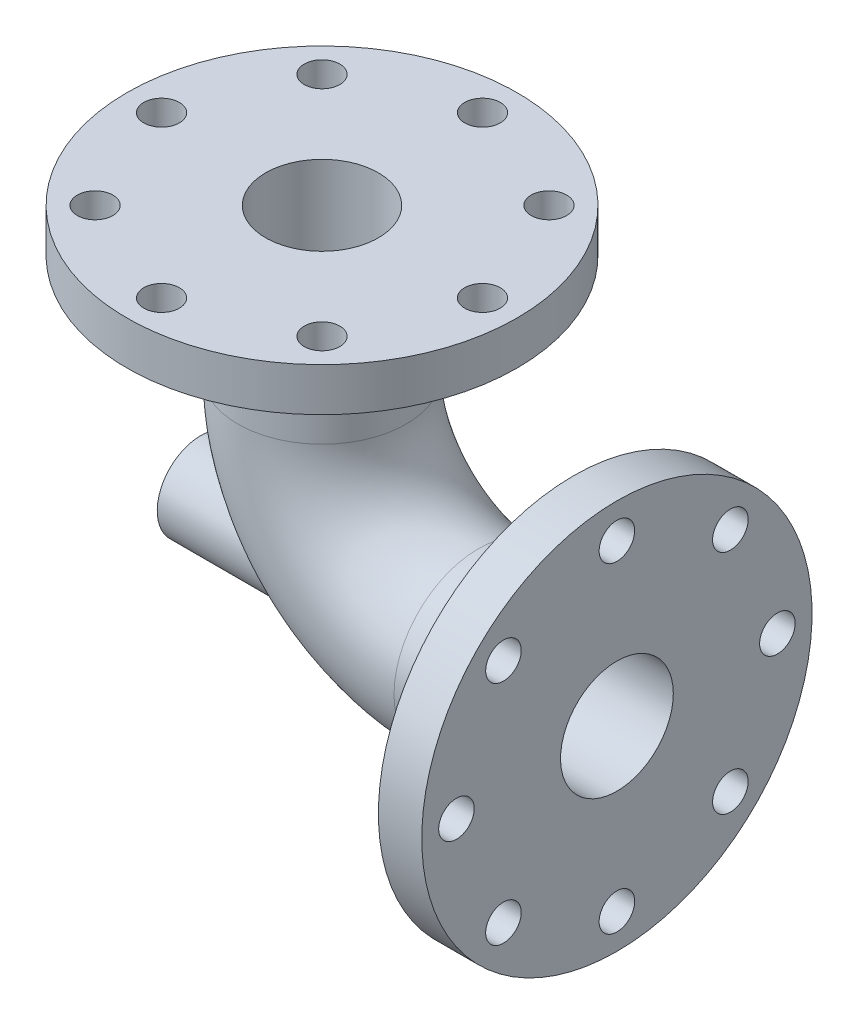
ISO-10303-21;
HEADER;
FILE_DESCRIPTION(('STEP AP214'),'2;1');
FILE_NAME('part.step','',(''),(''),'','','');
FILE_SCHEMA(('AUTOMOTIVE_DESIGN { 1 0 10303 214 1 1 1 1 }'));
ENDSEC;
DATA;
#1=APPLICATION_CONTEXT('core data for automotive mechanical design processes');
#2=APPLICATION_PROTOCOL_DEFINITION('international standard','automotive_design',2000,#1);
#3=PRODUCT_CONTEXT('',#1,'mechanical');
#4=PRODUCT('Part','Part','',(#3));
#5=PRODUCT_RELATED_PRODUCT_CATEGORY('part','',(#4));
#6=PRODUCT_DEFINITION_FORMATION('','',#4);
#7=PRODUCT_DEFINITION_CONTEXT('part definition',#1,'design');
#8=PRODUCT_DEFINITION('design','',#6,#7);
#9=PRODUCT_DEFINITION_SHAPE('','',#8);
#10=(LENGTH_UNIT() NAMED_UNIT(*) SI_UNIT(.MILLI.,.METRE.));
#11=(NAMED_UNIT(*) PLANE_ANGLE_UNIT() SI_UNIT($,.RADIAN.));
#12=(NAMED_UNIT(*) SI_UNIT($,.STERADIAN.) SOLID_ANGLE_UNIT());
#13=UNCERTAINTY_MEASURE_WITH_UNIT(LENGTH_MEASURE(1.E-05),#10,'distance_accuracy_value','');
#14=(GEOMETRIC_REPRESENTATION_CONTEXT(3) GLOBAL_UNCERTAINTY_ASSIGNED_CONTEXT((#13)) GLOBAL_UNIT_ASSIGNED_CONTEXT((#10,
#11,#12)) REPRESENTATION_CONTEXT('',''));
#15=CARTESIAN_POINT('',(0.,0.,0.));
#16=DIRECTION('',(0.,0.,1.));
#17=DIRECTION('',(1.,0.,0.));
#18=AXIS2_PLACEMENT_3D('',#15,#16,#17);
#19=CARTESIAN_POINT('',(0.,0.,0.));
#20=DIRECTION('',(0.,0.,-1.));
#21=DIRECTION('',(-1.,0.,0.));
#22=AXIS2_PLACEMENT_3D('',#19,#20,#21);
#23=TOROIDAL_SURFACE('',#22,90.,32.5);
#24=CARTESIAN_POINT('',(-90.,3.23269710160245E-13,0.));
#25=DIRECTION('',(0.,-1.,0.));
#26=DIRECTION('',(1.,0.,0.));
#27=AXIS2_PLACEMENT_3D('',#24,#25,#26);
#28=CIRCLE('',#27,32.5);
#29=CARTESIAN_POINT('',(-122.5,4.40005994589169E-13,0.));
#30=VERTEX_POINT('',#29);
#31=EDGE_CURVE('E45',#30,#30,#28,.T.);
#32=ORIENTED_EDGE('',*,*,#31,.F.);
#33=EDGE_LOOP('',(#32));
#34=FACE_BOUND('',#33,.T.);
#35=CARTESIAN_POINT('',(0.,-90.,0.));
#36=DIRECTION('',(1.,0.,0.));
#37=DIRECTION('',(0.,0.,-1.));
#38=AXIS2_PLACEMENT_3D('',#35,#36,#37);
#39=CIRCLE('',#38,32.5);
#40=CARTESIAN_POINT('',(0.,-90.,-32.5));
#41=VERTEX_POINT('',#40);
#42=EDGE_CURVE('E46',#41,#41,#39,.T.);
#43=ORIENTED_EDGE('',*,*,#42,.T.);
#44=EDGE_LOOP('',(#43));
#45=FACE_BOUND('',#44,.T.);
#46=CARTESIAN_POINT('',(-91.0499128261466,-81.3632191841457,-5.04044167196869));
#47=CARTESIAN_POINT('',(-90.8221232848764,-81.5448158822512,-5.3516179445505));
#48=CARTESIAN_POINT('',(-90.5796761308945,-81.7385465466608,-5.64499099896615));
#49=CARTESIAN_POINT('',(-90.0727091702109,-82.1448859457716,-6.19799224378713));
#50=CARTESIAN_POINT('',(-89.8081606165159,-82.3575192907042,-6.45757532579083));
#51=CARTESIAN_POINT('',(-89.2611177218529,-82.7987538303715,-6.94629633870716));
#52=CARTESIAN_POINT('',(-88.9785294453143,-83.0274393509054,-7.17525176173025));
#53=CARTESIAN_POINT('',(-88.4010527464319,-83.4966213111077,-7.60307896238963));
#54=CARTESIAN_POINT('',(-88.1061680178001,-83.737114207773,-7.80195969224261));
#55=CARTESIAN_POINT('',(-87.4114632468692,-84.3061891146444,-8.2307278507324));
#56=CARTESIAN_POINT('',(-87.0081966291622,-84.6383830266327,-8.45024504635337));
#57=CARTESIAN_POINT('',(-86.1908658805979,-85.316165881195,-8.84394219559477));
#58=CARTESIAN_POINT('',(-85.7767972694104,-85.6617604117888,-9.0181029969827));
#59=CARTESIAN_POINT('',(-84.9423574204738,-86.3634427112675,-9.32317871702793));
#60=CARTESIAN_POINT('',(-84.521991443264,-86.719521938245,-9.45412783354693));
#61=CARTESIAN_POINT('',(-83.6779906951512,-87.4404221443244,-9.67422146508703));
#62=CARTESIAN_POINT('',(-83.2543564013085,-87.8052418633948,-9.76337196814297));
#63=CARTESIAN_POINT('',(-82.3920030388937,-88.5547119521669,-9.90259432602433));
#64=CARTESIAN_POINT('',(-81.9532667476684,-88.9396126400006,-9.95121515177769));
#65=CARTESIAN_POINT('',(-81.0781921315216,-89.7153281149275,-10.0035039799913));
#66=CARTESIAN_POINT('',(-80.641854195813,-90.1061438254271,-10.0071648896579));
#67=CARTESIAN_POINT('',(-79.775089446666,-90.8912722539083,-9.96794865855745));
#68=CARTESIAN_POINT('',(-79.3446577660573,-91.285581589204,-9.92511249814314));
#69=CARTESIAN_POINT('',(-78.4927722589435,-92.0754446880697,-9.790452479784));
#70=CARTESIAN_POINT('',(-78.0713150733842,-92.4709979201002,-9.69864729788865));
#71=CARTESIAN_POINT('',(-77.3611409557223,-93.1460530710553,-9.49674028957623));
#72=CARTESIAN_POINT('',(-77.069226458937,-93.4260935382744,-9.39957056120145));
#73=CARTESIAN_POINT('',(-76.4935556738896,-93.9835247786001,-9.17723100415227));
#74=CARTESIAN_POINT('',(-76.2097991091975,-94.2609156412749,-9.05206212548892));
#75=CARTESIAN_POINT('',(-75.6527504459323,-94.8106724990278,-8.77225521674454));
#76=CARTESIAN_POINT('',(-75.3794469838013,-95.083043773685,-8.61765034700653));
#77=CARTESIAN_POINT('',(-74.8453492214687,-95.6204356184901,-8.27718699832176));
#78=CARTESIAN_POINT('',(-74.5845514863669,-95.8854581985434,-8.09133716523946));
#79=CARTESIAN_POINT('',(-74.1407432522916,-96.3407385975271,-7.73669848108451));
#80=CARTESIAN_POINT('',(-73.9544164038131,-96.5333098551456,-7.57501369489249));
#81=CARTESIAN_POINT('',(-73.5918198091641,-96.9106937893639,-7.23237520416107));
#82=CARTESIAN_POINT('',(-73.4155495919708,-97.095506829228,-7.05142240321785));
#83=CARTESIAN_POINT('',(-73.0748179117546,-97.4551777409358,-6.67000531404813));
#84=CARTESIAN_POINT('',(-72.910345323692,-97.6300449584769,-6.4695598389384));
#85=CARTESIAN_POINT('',(-72.5948297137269,-97.9676567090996,-6.04889464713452));
#86=CARTESIAN_POINT('',(-72.4437823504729,-98.1304051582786,-5.82868136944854));
#87=CARTESIAN_POINT('',(-72.1862353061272,-98.4095489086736,-5.415566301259));
#88=CARTESIAN_POINT('',(-72.0769261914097,-98.5286363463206,-5.22622912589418));
#89=CARTESIAN_POINT('',(-71.869134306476,-98.7560074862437,-4.8356339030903));
#90=CARTESIAN_POINT('',(-71.7706454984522,-98.8642972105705,-4.63438260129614));
#91=CARTESIAN_POINT('',(-71.5855074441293,-99.0686569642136,-4.22051178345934));
#92=CARTESIAN_POINT('',(-71.498858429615,-99.1647267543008,-4.00789204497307));
#93=CARTESIAN_POINT('',(-71.3384737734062,-99.3431514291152,-3.5722428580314));
#94=CARTESIAN_POINT('',(-71.2647383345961,-99.4255060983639,-3.34921324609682));
#95=CARTESIAN_POINT('',(-71.1306887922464,-99.5756420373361,-2.8922908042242));
#96=CARTESIAN_POINT('',(-71.0704830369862,-99.6433055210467,-2.6583272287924));
#97=CARTESIAN_POINT('',(-70.9651622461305,-99.7619237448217,-2.18285828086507));
#98=CARTESIAN_POINT('',(-70.9200474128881,-99.8128782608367,-1.94135280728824));
#99=CARTESIAN_POINT('',(-70.84568924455,-99.8969779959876,-1.45299048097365));
#100=CARTESIAN_POINT('',(-70.8164367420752,-99.9301335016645,-1.20613680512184));
#101=CARTESIAN_POINT('',(-70.7742875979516,-99.9779355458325,-0.70927093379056));
#102=CARTESIAN_POINT('',(-70.7613887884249,-99.9925845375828,-0.459259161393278));
#103=CARTESIAN_POINT('',(-70.7527553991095,-100.002388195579,0.00974748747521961));
#104=CARTESIAN_POINT('',(-70.7550556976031,-99.9997747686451,0.22866465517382));
#105=CARTESIAN_POINT('',(-70.7722683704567,-99.9802338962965,0.665345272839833));
#106=CARTESIAN_POINT('',(-70.7871794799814,-99.9633078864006,0.883108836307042));
#107=CARTESIAN_POINT('',(-70.8294030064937,-99.9154408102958,1.31583414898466));
#108=CARTESIAN_POINT('',(-70.8567136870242,-99.884501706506,1.53079628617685));
#109=CARTESIAN_POINT('',(-70.9233688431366,-99.8091310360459,1.95644179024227));
#110=CARTESIAN_POINT('',(-70.9627135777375,-99.76469917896,2.16712506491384));
#111=CARTESIAN_POINT('',(-71.0519290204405,-99.6641884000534,2.57822526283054));
#112=CARTESIAN_POINT('',(-71.1015463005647,-99.608390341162,2.7787662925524));
#113=CARTESIAN_POINT('',(-71.2112546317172,-99.4853591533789,3.17343752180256));
#114=CARTESIAN_POINT('',(-71.2713493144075,-99.4181220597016,3.36756547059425));
#115=CARTESIAN_POINT('',(-71.4013513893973,-99.273134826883,3.74839658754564));
#116=CARTESIAN_POINT('',(-71.4712564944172,-99.1953871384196,3.93510147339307));
#117=CARTESIAN_POINT('',(-71.6202403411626,-99.0302808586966,4.3004935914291));
#118=CARTESIAN_POINT('',(-71.6993224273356,-98.9429187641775,4.47917786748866));
#119=CARTESIAN_POINT('',(-71.8751657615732,-98.749422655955,4.84721079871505));
#120=CARTESIAN_POINT('',(-71.9729149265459,-98.6422810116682,5.03555862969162));
#121=CARTESIAN_POINT('',(-72.17793938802,-98.4186083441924,5.4012059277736));
#122=CARTESIAN_POINT('',(-72.2852184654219,-98.3020735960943,5.57850096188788));
#123=CARTESIAN_POINT('',(-72.6200535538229,-97.940169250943,6.09340475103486));
#124=CARTESIAN_POINT('',(-72.8606459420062,-97.6824569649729,6.41411157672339));
#125=CARTESIAN_POINT('',(-73.3135904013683,-97.2026285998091,6.94410248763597));
#126=CARTESIAN_POINT('',(-73.5205435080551,-96.9851217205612,7.16238988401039));
#127=CARTESIAN_POINT('',(-73.9488578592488,-96.5388905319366,7.57196088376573));
#128=CARTESIAN_POINT('',(-74.1702252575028,-96.3101614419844,7.76323284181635));
#129=CARTESIAN_POINT('',(-74.6253825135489,-95.8440188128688,8.11996277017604));
#130=CARTESIAN_POINT('',(-74.8591965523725,-95.6065886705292,8.28536783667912));
#131=CARTESIAN_POINT('',(-75.3368362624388,-95.1258364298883,8.59109658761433));
#132=CARTESIAN_POINT('',(-75.5806618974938,-94.8825143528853,8.7314203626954));
#133=CARTESIAN_POINT('',(-76.1746016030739,-94.2949663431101,9.03894339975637));
#134=CARTESIAN_POINT('',(-76.5286762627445,-93.9488270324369,9.19488348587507));
#135=CARTESIAN_POINT('',(-77.2492565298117,-93.2527012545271,9.46357278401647));
#136=CARTESIAN_POINT('',(-77.6157671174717,-92.9027132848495,9.57630446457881));
#137=CARTESIAN_POINT('',(-78.3582537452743,-92.2016667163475,9.76136097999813));
#138=CARTESIAN_POINT('',(-78.7342361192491,-91.8506075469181,9.83365798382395));
#139=CARTESIAN_POINT('',(-79.4927170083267,-91.1499183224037,9.93998215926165));
#140=CARTESIAN_POINT('',(-79.8752147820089,-90.800288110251,9.97401365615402));
#141=CARTESIAN_POINT('',(-80.6559479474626,-90.0937174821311,10.005997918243));
#142=CARTESIAN_POINT('',(-81.0543122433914,-89.7368704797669,10.0028431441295));
#143=CARTESIAN_POINT('',(-81.8532471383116,-89.0279554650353,9.95897904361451));
#144=CARTESIAN_POINT('',(-82.2538179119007,-88.6758878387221,9.91826670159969));
#145=CARTESIAN_POINT('',(-83.0549053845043,-87.9778931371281,9.79981683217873));
#146=CARTESIAN_POINT('',(-83.4554220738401,-87.6319666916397,9.72207552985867));
#147=CARTESIAN_POINT('',(-84.2539500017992,-86.9477043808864,9.52941881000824));
#148=CARTESIAN_POINT('',(-84.6519615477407,-86.609367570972,9.41450804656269));
#149=CARTESIAN_POINT('',(-85.4010455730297,-85.9771073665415,9.1607737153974));
#150=CARTESIAN_POINT('',(-85.7526351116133,-85.6822678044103,9.0257584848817));
#151=CARTESIAN_POINT('',(-86.4494936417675,-85.1012387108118,8.72406539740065));
#152=CARTESIAN_POINT('',(-86.7947618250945,-84.8150502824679,8.55738352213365));
#153=CARTESIAN_POINT('',(-87.4756141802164,-84.2535942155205,8.19091391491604));
#154=CARTESIAN_POINT('',(-87.8112114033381,-83.9783116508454,7.99117351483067));
#155=CARTESIAN_POINT('',(-88.4695143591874,-83.4407660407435,7.55618619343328));
#156=CARTESIAN_POINT('',(-88.7922266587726,-83.1784963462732,7.32095765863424));
#157=CARTESIAN_POINT('',(-89.3009031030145,-82.7667172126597,6.90864601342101));
#158=CARTESIAN_POINT('',(-89.4923382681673,-82.6121457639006,6.74331626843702));
#159=CARTESIAN_POINT('',(-89.8668274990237,-82.3104474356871,6.39714811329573));
#160=CARTESIAN_POINT('',(-90.0498837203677,-82.1633186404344,6.21631372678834));
#161=CARTESIAN_POINT('',(-90.4056719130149,-81.8779345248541,5.83849442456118));
#162=CARTESIAN_POINT('',(-90.5784124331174,-81.7396718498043,5.64152321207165));
#163=CARTESIAN_POINT('',(-90.9113686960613,-81.4736447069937,5.23079295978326));
#164=CARTESIAN_POINT('',(-91.0715877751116,-81.3458774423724,5.01703842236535));
#165=CARTESIAN_POINT('',(-91.4553398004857,-81.0403245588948,4.45770982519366));
#166=CARTESIAN_POINT('',(-91.6692072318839,-80.8704885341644,4.10074932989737));
#167=CARTESIAN_POINT('',(-91.9547871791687,-80.6440859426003,3.53665966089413));
#168=CARTESIAN_POINT('',(-92.0440944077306,-80.5733561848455,3.34390082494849));
#169=CARTESIAN_POINT('',(-92.2094050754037,-80.4425292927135,2.94922207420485));
#170=CARTESIAN_POINT('',(-92.2854112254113,-80.3824299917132,2.74730403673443));
#171=CARTESIAN_POINT('',(-92.4099232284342,-80.2840332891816,2.37283773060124));
#172=CARTESIAN_POINT('',(-92.4609165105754,-80.2437586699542,2.20163175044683));
#173=CARTESIAN_POINT('',(-92.5519609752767,-80.1718783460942,1.85456431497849));
#174=CARTESIAN_POINT('',(-92.5920144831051,-80.1402707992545,1.67870385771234));
#175=CARTESIAN_POINT('',(-92.6603876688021,-80.0863293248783,1.32340496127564));
#176=CARTESIAN_POINT('',(-92.6887137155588,-80.0639903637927,1.14396851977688));
#177=CARTESIAN_POINT('',(-92.7330622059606,-80.0290206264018,0.782631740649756));
#178=CARTESIAN_POINT('',(-92.7490845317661,-80.0163899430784,0.600731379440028));
#179=CARTESIAN_POINT('',(-92.7684912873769,-80.0010917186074,0.235307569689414));
#180=CARTESIAN_POINT('',(-92.7718391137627,-79.9984530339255,0.0517809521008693));
#181=CARTESIAN_POINT('',(-92.7657177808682,-80.0032781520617,-0.314924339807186));
#182=CARTESIAN_POINT('',(-92.7562485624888,-80.0107420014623,-0.498103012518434));
#183=CARTESIAN_POINT('',(-92.7247055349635,-80.0356099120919,-0.862752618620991));
#184=CARTESIAN_POINT('',(-92.7026270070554,-80.0530176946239,-1.04422288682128));
#185=CARTESIAN_POINT('',(-92.6463518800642,-80.0974016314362,-1.40407183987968));
#186=CARTESIAN_POINT('',(-92.6121553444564,-80.1243777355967,-1.58245054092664));
#187=CARTESIAN_POINT('',(-92.5337950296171,-80.1862187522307,-1.92859370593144));
#188=CARTESIAN_POINT('',(-92.4900381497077,-80.2207617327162,-2.09650841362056));
#189=CARTESIAN_POINT('',(-92.392679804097,-80.2976579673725,-2.42765217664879));
#190=CARTESIAN_POINT('',(-92.3390747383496,-80.3400140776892,-2.59087949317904));
#191=CARTESIAN_POINT('',(-92.1647518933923,-80.4778374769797,-3.07240878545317));
#192=CARTESIAN_POINT('',(-92.0304586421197,-80.5841132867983,-3.38284818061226));
#193=CARTESIAN_POINT('',(-91.7602074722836,-80.798332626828,-3.92400536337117));
#194=CARTESIAN_POINT('',(-91.6291575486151,-80.9023272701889,-4.15884422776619));
#195=CARTESIAN_POINT('',(-91.350932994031,-81.1234468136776,-4.61197117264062));
#196=CARTESIAN_POINT('',(-91.203766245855,-81.2405652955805,-4.83026725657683));
#197=CARTESIAN_POINT('',(-91.0499128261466,-81.3632191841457,-5.04044167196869));
#198=B_SPLINE_CURVE_WITH_KNOTS('',3,(#46,#47,#48,#49,#50,#51,#52,#53,#54,#55,#56,#57,#58,#59,
#60,#61,#62,#63,#64,#65,#66,#67,#68,#69,#70,#71,#72,#73,#74,#75,#76,#77,#78,#79,#80,#81,#82,#83,
#84,#85,#86,#87,#88,#89,#90,#91,#92,#93,#94,#95,#96,#97,#98,#99,#100,#101,#102,#103,#104,#105,
#106,#107,#108,#109,#110,#111,#112,#113,#114,#115,#116,#117,#118,#119,#120,#121,#122,#123,#124,
#125,#126,#127,#128,#129,#130,#131,#132,#133,#134,#135,#136,#137,#138,#139,#140,#141,#142,#143,
#144,#145,#146,#147,#148,#149,#150,#151,#152,#153,#154,#155,#156,#157,#158,#159,#160,#161,#162,
#163,#164,#165,#166,#167,#168,#169,#170,#171,#172,#173,#174,#175,#176,#177,#178,#179,#180,#181,
#182,#183,#184,#185,#186,#187,#188,#189,#190,#191,#192,#193,#194,#195,#196,#197),.UNSPECIFIED.,
.T.,.F.,(4,2,2,2,2,2,2,2,2,2,2,2,2,2,2,2,2,2,2,2,2,2,2,2,2,2,2,2,2,2,2,2,2,2,2,2,2,2,2,2,2,2,2,
2,2,2,2,2,2,2,2,2,2,2,2,2,2,2,2,2,2,2,2,2,2,2,2,2,2,2,2,2,2,2,2,4),(0.,1.27826428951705,
2.55821788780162,3.84548778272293,5.13237374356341,6.83008578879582,8.52851355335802,
10.2255939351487,11.922431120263,13.6776855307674,15.4332168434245,17.1872021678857,
18.9405190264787,20.1876998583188,21.4348383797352,22.6805801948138,23.9259778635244,
24.8641021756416,25.8021825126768,26.7393662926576,27.676245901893,28.4224257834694,
29.1681871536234,29.9139631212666,30.6597508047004,31.4113134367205,32.1628861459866,
32.9140240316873,33.6650623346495,34.3210804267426,34.9770327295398,35.6328931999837,
36.2887677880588,36.9300626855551,37.5715803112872,38.2129486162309,38.8545513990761,
39.5669946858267,40.2797219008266,41.7048849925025,42.8171159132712,43.9298248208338,
45.0447805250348,46.1597321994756,47.7148371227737,49.2705723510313,50.8273770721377,
52.3840058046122,53.9871107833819,55.5903444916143,57.1937416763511,58.7969381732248,
60.2307794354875,61.6648027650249,63.0967904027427,64.5280386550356,65.4168197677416,
66.3053709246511,67.1931752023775,68.0807421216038,69.4234625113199,70.0945254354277,
70.7654514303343,71.3142802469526,71.8629923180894,72.4114060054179,72.9598249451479,
73.5098264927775,74.059830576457,74.6100406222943,75.1602477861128,75.6904811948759,
76.2209088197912,77.2808648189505,78.1446496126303,79.0080138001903),.UNSPECIFIED.);
#199=CARTESIAN_POINT('',(-91.0499128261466,-81.3632191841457,-5.04044167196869));
#200=VERTEX_POINT('',#199);
#201=EDGE_CURVE('E28',#200,#200,#198,.T.);
#202=ORIENTED_EDGE('',*,*,#201,.T.);
#203=EDGE_LOOP('',(#202));
#204=FACE_BOUND('',#203,.T.);
#205=ADVANCED_FACE('F24',(#34,#45,#204),#23,.F.);
#206=CARTESIAN_POINT('',(-160.000000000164,-90.,0.));
#207=DIRECTION('',(-1.,0.,0.));
#208=DIRECTION('',(0.,-1.,0.));
#209=AXIS2_PLACEMENT_3D('',#206,#207,#208);
#210=PLANE('',#209);
#211=CARTESIAN_POINT('',(-160.000000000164,-90.,0.));
#212=DIRECTION('',(-1.,0.,0.));
#213=DIRECTION('',(0.,-1.,0.));
#214=AXIS2_PLACEMENT_3D('',#211,#212,#213);
#215=CIRCLE('',#214,25.);
#216=CARTESIAN_POINT('',(-160.000000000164,-115.,0.));
#217=VERTEX_POINT('',#216);
#218=EDGE_CURVE('E79',#217,#217,#215,.T.);
#219=ORIENTED_EDGE('',*,*,#218,.T.);
#220=EDGE_LOOP('',(#219));
#221=FACE_BOUND('',#220,.T.);
#222=CARTESIAN_POINT('',(-160.000000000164,-90.,0.));
#223=DIRECTION('',(-1.,0.,0.));
#224=DIRECTION('',(0.,0.,1.));
#225=AXIS2_PLACEMENT_3D('',#222,#223,#224);
#226=CIRCLE('',#225,12.);
#227=CARTESIAN_POINT('',(-160.000000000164,-90.,12.));
#228=VERTEX_POINT('',#227);
#229=EDGE_CURVE('E105',#228,#228,#226,.T.);
#230=ORIENTED_EDGE('',*,*,#229,.F.);
#231=EDGE_LOOP('',(#230));
#232=FACE_BOUND('',#231,.T.);
#233=ADVANCED_FACE('F89',(#221,#232),#210,.T.);
#234=CARTESIAN_POINT('',(-90.,3.20339729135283E-13,0.));
#235=DIRECTION('',(0.,1.,0.));
#236=DIRECTION('',(-1.,0.,0.));
#237=AXIS2_PLACEMENT_3D('',#234,#235,#236);
#238=CYLINDRICAL_SURFACE('',#237,48.5);
#239=CARTESIAN_POINT('',(-90.,3.20339729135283E-13,0.));
#240=DIRECTION('',(0.,-1.,0.));
#241=DIRECTION('',(1.,0.,0.));
#242=AXIS2_PLACEMENT_3D('',#239,#240,#241);
#243=CIRCLE('',#242,48.5);
#244=CARTESIAN_POINT('',(-138.5,4.97476165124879E-13,0.));
#245=VERTEX_POINT('',#244);
#246=EDGE_CURVE('E10',#245,#245,#243,.T.);
#247=CARTESIAN_POINT('',(-90.,60.,0.));
#248=DIRECTION('',(0.,1.,0.));
#249=DIRECTION('',(-1.,0.,0.));
#250=AXIS2_PLACEMENT_3D('',#247,#248,#249);
#251=CIRCLE('',#250,48.5);
#252=CARTESIAN_POINT('',(-138.5,60.0000000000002,0.));
#253=VERTEX_POINT('',#252);
#254=EDGE_CURVE('E49',#253,#253,#251,.T.);
#255=CARTESIAN_POINT('',(-138.5,4.97476165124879E-13,0.));
#256=CARTESIAN_POINT('',(-138.5,0.625000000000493,0.));
#257=CARTESIAN_POINT('',(-138.5,1.25000000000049,0.));
#258=CARTESIAN_POINT('',(-138.5,2.50000000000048,0.));
#259=CARTESIAN_POINT('',(-138.5,3.12500000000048,0.));
#260=CARTESIAN_POINT('',(-138.5,4.37500000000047,0.));
#261=CARTESIAN_POINT('',(-138.5,5.00000000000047,0.));
#262=CARTESIAN_POINT('',(-138.5,6.25000000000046,0.));
#263=CARTESIAN_POINT('',(-138.5,6.87500000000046,0.));
#264=CARTESIAN_POINT('',(-138.5,8.12500000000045,0.));
#265=CARTESIAN_POINT('',(-138.5,8.75000000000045,0.));
#266=CARTESIAN_POINT('',(-138.5,10.0000000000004,0.));
#267=CARTESIAN_POINT('',(-138.5,10.6250000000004,0.));
#268=CARTESIAN_POINT('',(-138.5,11.8750000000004,0.));
#269=CARTESIAN_POINT('',(-138.5,12.5000000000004,0.));
#270=CARTESIAN_POINT('',(-138.5,13.7500000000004,0.));
#271=CARTESIAN_POINT('',(-138.5,14.3750000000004,0.));
#272=CARTESIAN_POINT('',(-138.5,15.6250000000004,0.));
#273=CARTESIAN_POINT('',(-138.5,16.2500000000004,0.));
#274=CARTESIAN_POINT('',(-138.5,17.5000000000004,0.));
#275=CARTESIAN_POINT('',(-138.5,18.1250000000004,0.));
#276=CARTESIAN_POINT('',(-138.5,19.3750000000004,0.));
#277=CARTESIAN_POINT('',(-138.5,20.0000000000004,0.));
#278=CARTESIAN_POINT('',(-138.5,21.2500000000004,0.));
#279=CARTESIAN_POINT('',(-138.5,21.8750000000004,0.));
#280=CARTESIAN_POINT('',(-138.5,23.1250000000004,0.));
#281=CARTESIAN_POINT('',(-138.5,23.7500000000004,0.));
#282=CARTESIAN_POINT('',(-138.5,25.0000000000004,0.));
#283=CARTESIAN_POINT('',(-138.5,25.6250000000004,0.));
#284=CARTESIAN_POINT('',(-138.5,26.8750000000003,0.));
#285=CARTESIAN_POINT('',(-138.5,27.5000000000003,0.));
#286=CARTESIAN_POINT('',(-138.5,28.7500000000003,0.));
#287=CARTESIAN_POINT('',(-138.5,29.3750000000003,0.));
#288=CARTESIAN_POINT('',(-138.5,30.6250000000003,0.));
#289=CARTESIAN_POINT('',(-138.5,31.2500000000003,0.));
#290=CARTESIAN_POINT('',(-138.5,32.5000000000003,0.));
#291=CARTESIAN_POINT('',(-138.5,33.1250000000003,0.));
#292=CARTESIAN_POINT('',(-138.5,34.3750000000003,0.));
#293=CARTESIAN_POINT('',(-138.5,35.0000000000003,0.));
#294=CARTESIAN_POINT('',(-138.5,36.2500000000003,0.));
#295=CARTESIAN_POINT('',(-138.5,36.8750000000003,0.));
#296=CARTESIAN_POINT('',(-138.5,38.1250000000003,0.));
#297=CARTESIAN_POINT('',(-138.5,38.7500000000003,0.));
#298=CARTESIAN_POINT('',(-138.5,40.0000000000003,0.));
#299=CARTESIAN_POINT('',(-138.5,40.6250000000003,0.));
#300=CARTESIAN_POINT('',(-138.5,41.8750000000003,0.));
#301=CARTESIAN_POINT('',(-138.5,42.5000000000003,0.));
#302=CARTESIAN_POINT('',(-138.5,43.7500000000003,0.));
#303=CARTESIAN_POINT('',(-138.5,44.3750000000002,0.));
#304=CARTESIAN_POINT('',(-138.5,45.6250000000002,0.));
#305=CARTESIAN_POINT('',(-138.5,46.2500000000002,0.));
#306=CARTESIAN_POINT('',(-138.5,47.5000000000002,0.));
#307=CARTESIAN_POINT('',(-138.5,48.1250000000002,0.));
#308=CARTESIAN_POINT('',(-138.5,49.3750000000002,0.));
#309=CARTESIAN_POINT('',(-138.5,50.0000000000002,0.));
#310=CARTESIAN_POINT('',(-138.5,51.2500000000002,0.));
#311=CARTESIAN_POINT('',(-138.5,51.8750000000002,0.));
#312=CARTESIAN_POINT('',(-138.5,53.1250000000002,0.));
#313=CARTESIAN_POINT('',(-138.5,53.7500000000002,0.));
#314=CARTESIAN_POINT('',(-138.5,55.0000000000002,0.));
#315=CARTESIAN_POINT('',(-138.5,55.6250000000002,0.));
#316=CARTESIAN_POINT('',(-138.5,56.8750000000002,0.));
#317=CARTESIAN_POINT('',(-138.5,57.5000000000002,0.));
#318=CARTESIAN_POINT('',(-138.5,58.7500000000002,0.));
#319=CARTESIAN_POINT('',(-138.5,59.3750000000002,0.));
#320=CARTESIAN_POINT('',(-138.5,60.0000000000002,0.));
#321=B_SPLINE_CURVE_WITH_KNOTS('',3,(#255,#256,#257,#258,#259,#260,#261,#262,#263,#264,#265,
#266,#267,#268,#269,#270,#271,#272,#273,#274,#275,#276,#277,#278,#279,#280,#281,#282,#283,#284,
#285,#286,#287,#288,#289,#290,#291,#292,#293,#294,#295,#296,#297,#298,#299,#300,#301,#302,#303,
#304,#305,#306,#307,#308,#309,#310,#311,#312,#313,#314,#315,#316,#317,#318,#319,#320),
.UNSPECIFIED.,.F.,.F.,(4,2,2,2,2,2,2,2,2,2,2,2,2,2,2,2,2,2,2,2,2,2,2,2,2,2,2,2,2,2,2,2,4),(0.,
1.87499999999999,3.74999999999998,5.62499999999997,7.49999999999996,9.37499999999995,
11.2499999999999,13.1249999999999,14.9999999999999,16.8749999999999,18.7499999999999,
20.6249999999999,22.4999999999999,24.3749999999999,26.2499999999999,28.1249999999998,
29.9999999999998,31.8749999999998,33.7499999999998,35.6249999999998,37.4999999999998,
39.3749999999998,41.2499999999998,43.1249999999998,44.9999999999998,46.8749999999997,
48.7499999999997,50.6249999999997,52.4999999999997,54.3749999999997,56.2499999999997,
58.1249999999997,59.9999999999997),.UNSPECIFIED.);
#322=EDGE_CURVE('BSEAM26',#245,#253,#321,.T.);
#323=ORIENTED_EDGE('',*,*,#246,.F.);
#324=ORIENTED_EDGE('',*,*,#254,.F.);
#325=ORIENTED_EDGE('',*,*,#322,.T.);
#326=ORIENTED_EDGE('',*,*,#322,.F.);
#327=EDGE_LOOP('',(#323,#325,#324,#326));
#328=FACE_BOUND('',#327,.T.);
#329=ADVANCED_FACE('F26',(#328),#238,.T.);
#330=CARTESIAN_POINT('',(0.,0.,0.));
#331=DIRECTION('',(0.,0.,-1.));
#332=DIRECTION('',(-1.,0.,0.));
#333=AXIS2_PLACEMENT_3D('',#330,#331,#332);
#334=TOROIDAL_SURFACE('',#333,90.,48.5);
#335=CARTESIAN_POINT('',(-95.804715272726,-90.1644478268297,-24.9994591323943));
#336=CARTESIAN_POINT('',(-95.0822599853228,-90.9365578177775,-24.9943838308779));
#337=CARTESIAN_POINT('',(-94.3661701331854,-91.7147506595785,-24.953524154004));
#338=CARTESIAN_POINT('',(-92.9519119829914,-93.2804254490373,-24.79633228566));
#339=CARTESIAN_POINT('',(-92.2537521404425,-94.0679115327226,-24.6799651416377));
#340=CARTESIAN_POINT('',(-90.8805710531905,-95.6485156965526,-24.3668598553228));
#341=CARTESIAN_POINT('',(-90.2055702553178,-96.4416380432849,-24.1700525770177));
#342=CARTESIAN_POINT('',(-88.8855676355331,-98.026831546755,-23.6908227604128));
#343=CARTESIAN_POINT('',(-88.2405545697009,-98.8189029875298,-23.4084326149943));
#344=CARTESIAN_POINT('',(-87.130369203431,-100.213777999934,-22.8278648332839));
#345=CARTESIAN_POINT('',(-86.6578266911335,-100.818404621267,-22.5480965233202));
#346=CARTESIAN_POINT('',(-85.7373239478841,-102.01775261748,-21.9323477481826));
#347=CARTESIAN_POINT('',(-85.2893615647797,-102.612474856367,-21.5963722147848));
#348=CARTESIAN_POINT('',(-84.421370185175,-103.786104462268,-20.8667295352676));
#349=CARTESIAN_POINT('',(-84.0013231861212,-104.365021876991,-20.47310010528));
#350=CARTESIAN_POINT('',(-83.1918555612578,-105.501033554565,-19.627008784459));
#351=CARTESIAN_POINT('',(-82.8024352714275,-106.058127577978,-19.1745462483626));
#352=CARTESIAN_POINT('',(-82.0535811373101,-107.14842921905,-18.2062594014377));
#353=CARTESIAN_POINT('',(-81.6944659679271,-107.681360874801,-17.6898759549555));
#354=CARTESIAN_POINT('',(-81.0131049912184,-108.709676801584,-16.5984949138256));
#355=CARTESIAN_POINT('',(-80.6908604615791,-109.205059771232,-16.0234952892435));
#356=CARTESIAN_POINT('',(-80.085811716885,-110.149747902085,-14.8180207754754));
#357=CARTESIAN_POINT('',(-79.8029880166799,-110.599075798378,-14.1875735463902));
#358=CARTESIAN_POINT('',(-79.2786498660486,-111.443701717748,-12.8754059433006));
#359=CARTESIAN_POINT('',(-79.037127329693,-111.839010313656,-12.1936956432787));
#360=CARTESIAN_POINT('',(-78.6289709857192,-112.514976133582,-10.8874021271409));
#361=CARTESIAN_POINT('',(-78.4565549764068,-112.803946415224,-10.2689081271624));
#362=CARTESIAN_POINT('',(-78.1438181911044,-113.332576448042,-9.00338437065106));
#363=CARTESIAN_POINT('',(-78.0034942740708,-113.57224102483,-8.35635741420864));
#364=CARTESIAN_POINT('',(-77.7555933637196,-113.998471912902,-7.03933258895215));
#365=CARTESIAN_POINT('',(-77.6479993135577,-114.1850658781,-6.36934688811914));
#366=CARTESIAN_POINT('',(-77.4658816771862,-114.502383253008,-5.01187875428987));
#367=CARTESIAN_POINT('',(-77.3913557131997,-114.633110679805,-4.32439758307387));
#368=CARTESIAN_POINT('',(-77.2815512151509,-114.826230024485,-3.00899862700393));
#369=CARTESIAN_POINT('',(-77.2430422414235,-114.894236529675,-2.38216656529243));
#370=CARTESIAN_POINT('',(-77.1930023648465,-114.98267199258,-1.12411298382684));
#371=CARTESIAN_POINT('',(-77.1814691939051,-115.00310495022,-0.492891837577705));
#372=CARTESIAN_POINT('',(-77.1854087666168,-114.996132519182,0.769030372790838));
#373=CARTESIAN_POINT('',(-77.2008744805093,-114.968739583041,1.39973152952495));
#374=CARTESIAN_POINT('',(-77.2587553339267,-114.866496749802,2.65603222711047));
#375=CARTESIAN_POINT('',(-77.3011705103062,-114.791646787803,3.28163176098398));
#376=CARTESIAN_POINT('',(-77.4112225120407,-114.598286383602,4.5052049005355));
#377=CARTESIAN_POINT('',(-77.4780994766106,-114.481092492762,5.10345575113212));
#378=CARTESIAN_POINT('',(-77.6369710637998,-114.20428400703,6.28663270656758));
#379=CARTESIAN_POINT('',(-77.7289649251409,-114.044670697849,6.87155921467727));
#380=CARTESIAN_POINT('',(-77.9377958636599,-113.684935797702,8.02423427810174));
#381=CARTESIAN_POINT('',(-78.0546323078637,-113.484815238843,8.59198327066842));
#382=CARTESIAN_POINT('',(-78.3127825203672,-113.046408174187,9.70679394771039));
#383=CARTESIAN_POINT('',(-78.4540968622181,-112.808120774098,10.2538551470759));
#384=CARTESIAN_POINT('',(-78.7642703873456,-112.290185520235,11.3364889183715));
#385=CARTESIAN_POINT('',(-78.9336903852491,-112.00970948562,11.8715042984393));
#386=CARTESIAN_POINT('',(-79.2970159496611,-111.414900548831,12.9136372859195));
#387=CARTESIAN_POINT('',(-79.4909216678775,-111.100567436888,13.4207547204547));
#388=CARTESIAN_POINT('',(-79.9024687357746,-110.441489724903,14.4047279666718));
#389=CARTESIAN_POINT('',(-80.1201122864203,-110.096742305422,14.8815809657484));
#390=CARTESIAN_POINT('',(-80.5782190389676,-109.380468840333,15.803102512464));
#391=CARTESIAN_POINT('',(-80.8186831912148,-109.008941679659,16.2477697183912));
#392=CARTESIAN_POINT('',(-81.3406083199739,-108.213484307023,17.1362522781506));
#393=CARTESIAN_POINT('',(-81.6237977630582,-107.78771897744,17.5774088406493));
#394=CARTESIAN_POINT('',(-82.2139835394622,-106.913866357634,18.4198129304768));
#395=CARTESIAN_POINT('',(-82.5209804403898,-106.465778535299,18.821059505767));
#396=CARTESIAN_POINT('',(-83.157314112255,-105.551405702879,19.5833661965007));
#397=CARTESIAN_POINT('',(-83.4866581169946,-105.08511482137,19.9444131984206));
#398=CARTESIAN_POINT('',(-84.1660214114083,-104.138324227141,20.6263966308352));
#399=CARTESIAN_POINT('',(-84.5160446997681,-103.657821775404,20.9473252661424));
#400=CARTESIAN_POINT('',(-85.1293999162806,-102.828967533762,21.4611420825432));
#401=CARTESIAN_POINT('',(-85.388017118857,-102.483229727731,21.6639611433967));
#402=CARTESIAN_POINT('',(-85.9140012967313,-101.787712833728,22.0501252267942));
#403=CARTESIAN_POINT('',(-86.1813666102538,-101.437934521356,22.2334739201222));
#404=CARTESIAN_POINT('',(-86.9959459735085,-100.383761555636,22.7550498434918));
#405=CARTESIAN_POINT('',(-87.555563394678,-99.6746372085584,23.0647403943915));
#406=CARTESIAN_POINT('',(-88.7035925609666,-98.2501632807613,23.6118225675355));
#407=CARTESIAN_POINT('',(-89.2920491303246,-97.5348055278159,23.8490972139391));
#408=CARTESIAN_POINT('',(-90.4923470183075,-96.1043100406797,24.2546918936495));
#409=CARTESIAN_POINT('',(-91.1041890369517,-95.3891723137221,24.4230098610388));
#410=CARTESIAN_POINT('',(-92.5445002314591,-93.7364695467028,24.7377067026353));
#411=CARTESIAN_POINT('',(-93.3800157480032,-92.8004486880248,24.8601110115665));
#412=CARTESIAN_POINT('',(-95.0750044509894,-90.9422351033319,24.9996154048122));
#413=CARTESIAN_POINT('',(-95.9344856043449,-90.020047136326,25.0166800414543));
#414=CARTESIAN_POINT('',(-97.6701634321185,-88.1924538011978,24.9513582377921));
#415=CARTESIAN_POINT('',(-98.5463852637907,-87.2870785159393,24.8688082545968));
#416=CARTESIAN_POINT('',(-100.306211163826,-85.497678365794,24.6078556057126));
#417=CARTESIAN_POINT('',(-101.189814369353,-84.6136510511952,24.4294639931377));
#418=CARTESIAN_POINT('',(-102.522829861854,-83.2977580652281,24.0892101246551));
#419=CARTESIAN_POINT('',(-102.972530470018,-82.8568875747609,23.9621946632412));
#420=CARTESIAN_POINT('',(-103.870811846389,-81.9816931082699,23.6837009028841));
#421=CARTESIAN_POINT('',(-104.319392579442,-81.5473693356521,23.5322218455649));
#422=CARTESIAN_POINT('',(-105.214416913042,-80.6856214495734,23.204630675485));
#423=CARTESIAN_POINT('',(-105.660859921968,-80.2581991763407,23.0285121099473));
#424=CARTESIAN_POINT('',(-106.550306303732,-79.410897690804,22.6514000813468));
#425=CARTESIAN_POINT('',(-106.993310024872,-78.9910177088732,22.4504091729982));
#426=CARTESIAN_POINT('',(-107.873785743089,-78.1602037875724,22.0235531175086));
#427=CARTESIAN_POINT('',(-108.31126726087,-77.7492531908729,21.7977401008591));
#428=CARTESIAN_POINT('',(-109.180313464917,-76.9361015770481,21.3203389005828));
#429=CARTESIAN_POINT('',(-109.611877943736,-76.5339008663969,21.0687498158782));
#430=CARTESIAN_POINT('',(-110.467391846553,-75.739326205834,20.5392549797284));
#431=CARTESIAN_POINT('',(-110.891345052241,-75.3469473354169,20.2613627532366));
#432=CARTESIAN_POINT('',(-111.730155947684,-74.5729133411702,19.6784071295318));
#433=CARTESIAN_POINT('',(-112.145014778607,-74.1912568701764,19.3733471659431));
#434=CARTESIAN_POINT('',(-113.052728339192,-73.3583196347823,18.6658625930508));
#435=CARTESIAN_POINT('',(-113.542973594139,-72.9099015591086,18.2566745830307));
#436=CARTESIAN_POINT('',(-114.503425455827,-72.0336135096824,17.3950135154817));
#437=CARTESIAN_POINT('',(-114.973633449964,-71.6057421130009,16.942543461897));
#438=CARTESIAN_POINT('',(-115.888971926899,-70.774501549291,15.9930593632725));
#439=CARTESIAN_POINT('',(-116.334126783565,-70.3711085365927,15.4960898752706));
#440=CARTESIAN_POINT('',(-117.194295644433,-69.5928616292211,14.4558101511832));
#441=CARTESIAN_POINT('',(-117.609316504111,-69.218001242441,13.912510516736));
#442=CARTESIAN_POINT('',(-118.314411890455,-68.5818926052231,12.9048960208));
#443=CARTESIAN_POINT('',(-118.611743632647,-68.31392110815,12.4498961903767));
#444=CARTESIAN_POINT('',(-119.180736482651,-67.8014897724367,11.5113816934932));
#445=CARTESIAN_POINT('',(-119.452398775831,-67.5570288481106,11.027868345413));
#446=CARTESIAN_POINT('',(-119.965892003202,-67.0952093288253,10.0334824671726));
#447=CARTESIAN_POINT('',(-120.207752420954,-66.8778239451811,9.52263770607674));
#448=CARTESIAN_POINT('',(-120.657757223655,-66.4735232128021,8.4746728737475));
#449=CARTESIAN_POINT('',(-120.865908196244,-66.2866019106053,7.93755796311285));
#450=CARTESIAN_POINT('',(-121.21022751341,-65.9774895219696,6.93838478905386));
#451=CARTESIAN_POINT('',(-121.35260929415,-65.8497026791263,6.48019221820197));
#452=CARTESIAN_POINT('',(-121.609585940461,-65.619107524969,5.54992070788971));
#453=CARTESIAN_POINT('',(-121.7241838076,-65.5162965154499,5.0778432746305));
#454=CARTESIAN_POINT('',(-121.923516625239,-65.3374865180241,4.12266529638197));
#455=CARTESIAN_POINT('',(-122.008267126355,-65.261473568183,3.63957063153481));
#456=CARTESIAN_POINT('',(-122.146351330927,-65.1376337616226,2.66530417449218));
#457=CARTESIAN_POINT('',(-122.199684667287,-65.0898072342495,2.17413228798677));
#458=CARTESIAN_POINT('',(-122.273958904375,-65.0232036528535,1.18567722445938));
#459=CARTESIAN_POINT('',(-122.294788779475,-65.0045261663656,0.688378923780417));
#460=CARTESIAN_POINT('',(-122.303259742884,-64.9969304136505,-0.306730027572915));
#461=CARTESIAN_POINT('',(-122.290900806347,-65.0080121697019,-0.804540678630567));
#462=CARTESIAN_POINT('',(-122.233257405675,-65.0597014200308,-1.7967616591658));
#463=CARTESIAN_POINT('',(-122.187968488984,-65.1003129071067,-2.29117151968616));
#464=CARTESIAN_POINT('',(-122.065409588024,-65.2102244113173,-3.27275680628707));
#465=CARTESIAN_POINT('',(-121.988139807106,-65.2795242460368,-3.75993227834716));
#466=CARTESIAN_POINT('',(-121.807595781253,-65.4414694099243,-4.70056869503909));
#467=CARTESIAN_POINT('',(-121.705745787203,-65.532836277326,-5.15452626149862));
#468=CARTESIAN_POINT('',(-121.476153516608,-65.7388357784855,-6.05038586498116));
#469=CARTESIAN_POINT('',(-121.348412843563,-65.8534669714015,-6.49228864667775));
#470=CARTESIAN_POINT('',(-121.068922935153,-66.1043359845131,-7.36221615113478));
#471=CARTESIAN_POINT('',(-120.917168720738,-66.240578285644,-7.79023797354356));
#472=CARTESIAN_POINT('',(-120.591684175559,-66.5328857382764,-8.63091605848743));
#473=CARTESIAN_POINT('',(-120.417949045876,-66.6889552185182,-9.04356894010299));
#474=CARTESIAN_POINT('',(-119.967749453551,-67.0935391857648,-10.0347125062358));
#475=CARTESIAN_POINT('',(-119.680263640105,-67.3520270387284,-10.6041703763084));
#476=CARTESIAN_POINT('',(-119.069308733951,-67.9017943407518,-11.7068022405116));
#477=CARTESIAN_POINT('',(-118.745826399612,-68.1930858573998,-12.2399627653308));
#478=CARTESIAN_POINT('',(-118.06780002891,-68.8042753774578,-13.2702912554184));
#479=CARTESIAN_POINT('',(-117.713204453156,-69.1242208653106,-13.7673969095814));
#480=CARTESIAN_POINT('',(-116.978270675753,-69.7882198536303,-14.724926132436));
#481=CARTESIAN_POINT('',(-116.597931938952,-70.1322738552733,-15.1853489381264));
#482=CARTESIAN_POINT('',(-115.641243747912,-70.9991209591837,-16.2677192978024));
#483=CARTESIAN_POINT('',(-115.053079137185,-71.5332384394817,-16.8702081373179));
#484=CARTESIAN_POINT('',(-113.841935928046,-72.6366052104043,-18.003849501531));
#485=CARTESIAN_POINT('',(-113.218942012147,-73.2058699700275,-18.5349702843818));
#486=CARTESIAN_POINT('',(-111.945172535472,-74.3745677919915,-19.5303943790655));
#487=CARTESIAN_POINT('',(-111.294337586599,-74.9740658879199,-19.9945445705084));
#488=CARTESIAN_POINT('',(-109.973009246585,-76.1974486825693,-20.8578534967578));
#489=CARTESIAN_POINT('',(-109.302516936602,-76.8213320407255,-21.2570157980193));
#490=CARTESIAN_POINT('',(-108.16881502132,-77.8828995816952,-21.8728065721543));
#491=CARTESIAN_POINT('',(-107.709401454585,-78.3148724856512,-22.1064814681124));
#492=CARTESIAN_POINT('',(-106.785656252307,-79.1876266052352,-22.5462054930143));
#493=CARTESIAN_POINT('',(-106.321324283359,-79.6284084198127,-22.7522527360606));
#494=CARTESIAN_POINT('',(-105.388975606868,-80.5182765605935,-23.1372436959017));
#495=CARTESIAN_POINT('',(-104.920957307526,-80.9673666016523,-23.3161749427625));
#496=CARTESIAN_POINT('',(-103.9827526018,-81.8731040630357,-23.6471144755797));
#497=CARTESIAN_POINT('',(-103.512566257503,-82.3297512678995,-23.7991235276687));
#498=CARTESIAN_POINT('',(-102.572551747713,-83.2488761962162,-24.0759641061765));
#499=CARTESIAN_POINT('',(-102.102726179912,-83.7113343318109,-24.2008695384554));
#500=CARTESIAN_POINT('',(-101.163306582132,-84.6429202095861,-24.4239863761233));
#501=CARTESIAN_POINT('',(-100.693712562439,-85.1120482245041,-24.5221966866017));
#502=CARTESIAN_POINT('',(-99.7563138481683,-86.0561919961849,-24.6916227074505));
#503=CARTESIAN_POINT('',(-99.2885080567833,-86.5312029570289,-24.7628590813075));
#504=CARTESIAN_POINT('',(-98.3555077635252,-87.487048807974,-24.8780382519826));
#505=CARTESIAN_POINT('',(-97.8903131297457,-87.9678833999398,-24.9219824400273));
#506=CARTESIAN_POINT('',(-97.1552144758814,-88.7350769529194,-24.969596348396));
#507=CARTESIAN_POINT('',(-96.8840514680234,-89.0196871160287,-24.982404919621));
#508=CARTESIAN_POINT('',(-96.3432033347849,-89.5907330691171,-24.9982820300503));
#509=CARTESIAN_POINT('',(-96.0735187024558,-89.8771694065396,-25.0013474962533));
#510=CARTESIAN_POINT('',(-95.804715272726,-90.1644478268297,-24.9994591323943));
#511=B_SPLINE_CURVE_WITH_KNOTS('',3,(#335,#336,#337,#338,#339,#340,#341,#342,#343,#344,#345,
#346,#347,#348,#349,#350,#351,#352,#353,#354,#355,#356,#357,#358,#359,#360,#361,#362,#363,#364,
#365,#366,#367,#368,#369,#370,#371,#372,#373,#374,#375,#376,#377,#378,#379,#380,#381,#382,#383,
#384,#385,#386,#387,#388,#389,#390,#391,#392,#393,#394,#395,#396,#397,#398,#399,#400,#401,#402,
#403,#404,#405,#406,#407,#408,#409,#410,#411,#412,#413,#414,#415,#416,#417,#418,#419,#420,#421,
#422,#423,#424,#425,#426,#427,#428,#429,#430,#431,#432,#433,#434,#435,#436,#437,#438,#439,#440,
#441,#442,#443,#444,#445,#446,#447,#448,#449,#450,#451,#452,#453,#454,#455,#456,#457,#458,#459,
#460,#461,#462,#463,#464,#465,#466,#467,#468,#469,#470,#471,#472,#473,#474,#475,#476,#477,#478,
#479,#480,#481,#482,#483,#484,#485,#486,#487,#488,#489,#490,#491,#492,#493,#494,#495,#496,#497,
#498,#499,#500,#501,#502,#503,#504,#505,#506,#507,#508,#509,#510),.UNSPECIFIED.,.T.,.F.,(4,2,2,
2,2,2,2,2,2,2,2,2,2,2,2,2,2,2,2,2,2,2,2,2,2,2,2,2,2,2,2,2,2,2,2,2,2,2,2,2,2,2,2,2,2,2,2,2,2,2,2,
2,2,2,2,2,2,2,2,2,2,2,2,2,2,2,2,2,2,2,2,2,2,2,2,2,2,2,2,2,2,2,2,2,2,2,2,4),(0.,3.17197352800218,
6.34541641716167,9.52159254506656,12.6965679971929,15.1447986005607,17.5928145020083,
20.0392360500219,22.4856844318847,24.9552862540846,27.4249736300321,29.8934359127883,
32.3614143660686,34.470840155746,36.5800593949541,38.6881775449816,40.7961440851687,
42.6888726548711,44.5814420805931,46.4735188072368,48.3655981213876,50.2033020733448,
52.0409503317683,53.878551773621,55.7161962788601,57.5962847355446,59.4763848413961,
61.3566594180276,63.2370123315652,65.2609751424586,67.2849862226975,69.3096556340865,
71.3347178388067,72.7653075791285,74.1956271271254,77.0567152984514,79.9224009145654,
82.7881723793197,86.5647468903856,90.3425921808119,94.1266482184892,97.9102679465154,
99.837182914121,101.76415762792,103.691637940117,105.618920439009,107.542229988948,
109.465606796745,111.387999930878,113.310150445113,115.649394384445,117.988476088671,
120.325241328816,122.661473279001,124.478002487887,126.294447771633,128.109081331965,
129.92335984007,131.411477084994,132.899433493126,134.386613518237,135.873810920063,
137.366077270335,138.858344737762,140.350814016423,141.843273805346,143.264184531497,
144.685007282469,146.106125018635,147.527553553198,149.589299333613,151.651806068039,
153.717796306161,155.783829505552,158.770594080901,161.758682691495,164.753498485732,
167.748149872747,169.765075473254,171.782138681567,173.800126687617,175.818057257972,
177.830414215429,179.842853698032,181.853748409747,183.864540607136,185.044362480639,
186.224556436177),.UNSPECIFIED.);
#512=CARTESIAN_POINT('',(-95.804715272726,-90.1644478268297,-24.9994591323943));
#513=VERTEX_POINT('',#512);
#514=EDGE_CURVE('E72',#513,#513,#511,.T.);
#515=ORIENTED_EDGE('',*,*,#514,.F.);
#516=EDGE_LOOP('',(#515));
#517=FACE_BOUND('',#516,.T.);
#518=CARTESIAN_POINT('',(0.,-90.,0.));
#519=DIRECTION('',(1.,0.,0.));
#520=DIRECTION('',(0.,1.,0.));
#521=AXIS2_PLACEMENT_3D('',#518,#519,#520);
#522=CIRCLE('',#521,48.5);
#523=CARTESIAN_POINT('',(0.,-41.5,0.));
#524=VERTEX_POINT('',#523);
#525=EDGE_CURVE('E36',#524,#524,#522,.T.);
#526=ORIENTED_EDGE('',*,*,#525,.F.);
#527=EDGE_LOOP('',(#526));
#528=FACE_BOUND('',#527,.T.);
#529=ORIENTED_EDGE('',*,*,#246,.T.);
#530=EDGE_LOOP('',(#529));
#531=FACE_BOUND('',#530,.T.);
#532=ADVANCED_FACE('F97',(#517,#528,#531),#334,.T.);
#533=CARTESIAN_POINT('',(0.,-90.,0.));
#534=DIRECTION('',(1.,0.,0.));
#535=DIRECTION('',(0.,0.,-1.));
#536=AXIS2_PLACEMENT_3D('',#533,#534,#535);
#537=CYLINDRICAL_SURFACE('',#536,48.5);
#538=ORIENTED_EDGE('',*,*,#525,.T.);
#539=EDGE_LOOP('',(#538));
#540=FACE_BOUND('',#539,.T.);
#541=CARTESIAN_POINT('',(55.,-90.,0.));
#542=DIRECTION('',(1.,0.,0.));
#543=DIRECTION('',(0.,1.,0.));
#544=AXIS2_PLACEMENT_3D('',#541,#542,#543);
#545=CIRCLE('',#544,48.5);
#546=CARTESIAN_POINT('',(55.,-41.5,0.));
#547=VERTEX_POINT('',#546);
#548=EDGE_CURVE('E40',#547,#547,#545,.T.);
#549=ORIENTED_EDGE('',*,*,#548,.F.);
#550=EDGE_LOOP('',(#549));
#551=FACE_BOUND('',#550,.T.);
#552=ADVANCED_FACE('F232',(#540,#551),#537,.T.);
#553=CARTESIAN_POINT('',(-90.,3.20339729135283E-13,0.));
#554=DIRECTION('',(0.,1.,0.));
#555=DIRECTION('',(-1.,0.,0.));
#556=AXIS2_PLACEMENT_3D('',#553,#554,#555);
#557=CYLINDRICAL_SURFACE('',#556,32.5);
#558=CARTESIAN_POINT('',(-89.9999999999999,85.,0.));
#559=DIRECTION('',(0.,1.,0.));
#560=DIRECTION('',(-1.,0.,0.));
#561=AXIS2_PLACEMENT_3D('',#558,#559,#560);
#562=CIRCLE('',#561,32.5);
#563=CARTESIAN_POINT('',(-122.5,85.0000000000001,0.));
#564=VERTEX_POINT('',#563);
#565=EDGE_CURVE('E60',#564,#564,#562,.T.);
#566=CARTESIAN_POINT('',(-122.5,4.40005994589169E-13,0.));
#567=CARTESIAN_POINT('',(-122.5,0.885416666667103,0.));
#568=CARTESIAN_POINT('',(-122.5,1.77083333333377,0.));
#569=CARTESIAN_POINT('',(-122.5,3.54166666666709,0.));
#570=CARTESIAN_POINT('',(-122.5,4.42708333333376,0.));
#571=CARTESIAN_POINT('',(-122.5,6.19791666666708,0.));
#572=CARTESIAN_POINT('',(-122.5,7.08333333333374,0.));
#573=CARTESIAN_POINT('',(-122.5,8.85416666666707,0.));
#574=CARTESIAN_POINT('',(-122.5,9.73958333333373,0.));
#575=CARTESIAN_POINT('',(-122.5,11.5104166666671,0.));
#576=CARTESIAN_POINT('',(-122.5,12.3958333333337,0.));
#577=CARTESIAN_POINT('',(-122.5,14.166666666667,0.));
#578=CARTESIAN_POINT('',(-122.5,15.0520833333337,0.));
#579=CARTESIAN_POINT('',(-122.5,16.822916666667,0.));
#580=CARTESIAN_POINT('',(-122.5,17.7083333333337,0.));
#581=CARTESIAN_POINT('',(-122.5,19.479166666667,0.));
#582=CARTESIAN_POINT('',(-122.5,20.3645833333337,0.));
#583=CARTESIAN_POINT('',(-122.5,22.135416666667,0.));
#584=CARTESIAN_POINT('',(-122.5,23.0208333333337,0.));
#585=CARTESIAN_POINT('',(-122.5,24.791666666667,0.));
#586=CARTESIAN_POINT('',(-122.5,25.6770833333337,0.));
#587=CARTESIAN_POINT('',(-122.5,27.447916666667,0.));
#588=CARTESIAN_POINT('',(-122.5,28.3333333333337,0.));
#589=CARTESIAN_POINT('',(-122.5,30.104166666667,0.));
#590=CARTESIAN_POINT('',(-122.5,30.9895833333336,0.));
#591=CARTESIAN_POINT('',(-122.5,32.760416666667,0.));
#592=CARTESIAN_POINT('',(-122.5,33.6458333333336,0.));
#593=CARTESIAN_POINT('',(-122.5,35.416666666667,0.));
#594=CARTESIAN_POINT('',(-122.5,36.3020833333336,0.));
#595=CARTESIAN_POINT('',(-122.5,38.0729166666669,0.));
#596=CARTESIAN_POINT('',(-122.5,38.9583333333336,0.));
#597=CARTESIAN_POINT('',(-122.5,40.7291666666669,0.));
#598=CARTESIAN_POINT('',(-122.5,41.6145833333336,0.));
#599=CARTESIAN_POINT('',(-122.5,43.3854166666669,0.));
#600=CARTESIAN_POINT('',(-122.5,44.2708333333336,0.));
#601=CARTESIAN_POINT('',(-122.5,46.0416666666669,0.));
#602=CARTESIAN_POINT('',(-122.5,46.9270833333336,0.));
#603=CARTESIAN_POINT('',(-122.5,48.6979166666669,0.));
#604=CARTESIAN_POINT('',(-122.5,49.5833333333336,0.));
#605=CARTESIAN_POINT('',(-122.5,51.3541666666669,0.));
#606=CARTESIAN_POINT('',(-122.5,52.2395833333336,0.));
#607=CARTESIAN_POINT('',(-122.5,54.0104166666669,0.));
#608=CARTESIAN_POINT('',(-122.5,54.8958333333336,0.));
#609=CARTESIAN_POINT('',(-122.5,56.6666666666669,0.));
#610=CARTESIAN_POINT('',(-122.5,57.5520833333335,0.));
#611=CARTESIAN_POINT('',(-122.5,59.3229166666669,0.));
#612=CARTESIAN_POINT('',(-122.5,60.2083333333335,0.));
#613=CARTESIAN_POINT('',(-122.5,61.9791666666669,0.));
#614=CARTESIAN_POINT('',(-122.5,62.8645833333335,0.));
#615=CARTESIAN_POINT('',(-122.5,64.6354166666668,0.));
#616=CARTESIAN_POINT('',(-122.5,65.5208333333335,0.));
#617=CARTESIAN_POINT('',(-122.5,67.2916666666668,0.));
#618=CARTESIAN_POINT('',(-122.5,68.1770833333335,0.));
#619=CARTESIAN_POINT('',(-122.5,69.9479166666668,0.));
#620=CARTESIAN_POINT('',(-122.5,70.8333333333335,0.));
#621=CARTESIAN_POINT('',(-122.5,72.6041666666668,0.));
#622=CARTESIAN_POINT('',(-122.5,73.4895833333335,0.));
#623=CARTESIAN_POINT('',(-122.5,75.2604166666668,0.));
#624=CARTESIAN_POINT('',(-122.5,76.1458333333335,0.));
#625=CARTESIAN_POINT('',(-122.5,77.9166666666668,0.));
#626=CARTESIAN_POINT('',(-122.5,78.8020833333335,0.));
#627=CARTESIAN_POINT('',(-122.5,80.5729166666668,0.));
#628=CARTESIAN_POINT('',(-122.5,81.4583333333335,0.));
#629=CARTESIAN_POINT('',(-122.5,83.2291666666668,0.));
#630=CARTESIAN_POINT('',(-122.5,84.1145833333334,0.));
#631=CARTESIAN_POINT('',(-122.5,85.0000000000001,0.));
#632=B_SPLINE_CURVE_WITH_KNOTS('',3,(#566,#567,#568,#569,#570,#571,#572,#573,#574,#575,#576,
#577,#578,#579,#580,#581,#582,#583,#584,#585,#586,#587,#588,#589,#590,#591,#592,#593,#594,#595,
#596,#597,#598,#599,#600,#601,#602,#603,#604,#605,#606,#607,#608,#609,#610,#611,#612,#613,#614,
#615,#616,#617,#618,#619,#620,#621,#622,#623,#624,#625,#626,#627,#628,#629,#630,#631),
.UNSPECIFIED.,.F.,.F.,(4,2,2,2,2,2,2,2,2,2,2,2,2,2,2,2,2,2,2,2,2,2,2,2,2,2,2,2,2,2,2,2,4),(0.,
2.65624999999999,5.31249999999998,7.96874999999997,10.625,13.2812499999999,15.9374999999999,
18.5937499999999,21.2499999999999,23.9062499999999,26.5624999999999,29.2187499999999,
31.8749999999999,34.5312499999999,37.1874999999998,39.8437499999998,42.4999999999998,
45.1562499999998,47.8124999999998,50.4687499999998,53.1249999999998,55.7812499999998,
58.4374999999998,61.0937499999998,63.7499999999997,66.4062499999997,69.0624999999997,
71.7187499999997,74.3749999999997,77.0312499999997,79.6874999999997,82.3437499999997,
84.9999999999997),.UNSPECIFIED.);
#633=EDGE_CURVE('BSEAM229',#30,#564,#632,.T.);
#634=ORIENTED_EDGE('',*,*,#31,.T.);
#635=ORIENTED_EDGE('',*,*,#565,.T.);
#636=ORIENTED_EDGE('',*,*,#633,.T.);
#637=ORIENTED_EDGE('',*,*,#633,.F.);
#638=EDGE_LOOP('',(#634,#636,#635,#637));
#639=FACE_BOUND('',#638,.T.);
#640=ADVANCED_FACE('F229',(#639),#557,.F.);
#641=CARTESIAN_POINT('',(0.,-90.,0.));
#642=DIRECTION('',(1.,0.,0.));
#643=DIRECTION('',(0.,0.,-1.));
#644=AXIS2_PLACEMENT_3D('',#641,#642,#643);
#645=CYLINDRICAL_SURFACE('',#644,32.5);
#646=ORIENTED_EDGE('',*,*,#42,.F.);
#647=EDGE_LOOP('',(#646));
#648=FACE_BOUND('',#647,.T.);
#649=CARTESIAN_POINT('',(79.9999999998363,-90.,0.));
#650=DIRECTION('',(1.,0.,0.));
#651=DIRECTION('',(0.,1.,0.));
#652=AXIS2_PLACEMENT_3D('',#649,#650,#651);
#653=CIRCLE('',#652,32.5);
#654=CARTESIAN_POINT('',(79.9999999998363,-57.5,0.));
#655=VERTEX_POINT('',#654);
#656=EDGE_CURVE('E69',#655,#655,#653,.T.);
#657=ORIENTED_EDGE('',*,*,#656,.T.);
#658=EDGE_LOOP('',(#657));
#659=FACE_BOUND('',#658,.T.);
#660=ADVANCED_FACE('F231',(#648,#659),#645,.F.);
#661=CARTESIAN_POINT('',(-90.,60.,0.));
#662=DIRECTION('',(0.,1.,0.));
#663=DIRECTION('',(-1.,0.,0.));
#664=AXIS2_PLACEMENT_3D('',#661,#662,#663);
#665=PLANE('',#664);
#666=CARTESIAN_POINT('',(-155.407377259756,60.0000000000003,-65.4073772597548));
#667=DIRECTION('',(0.,1.,0.));
#668=DIRECTION('',(-0.707106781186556,0.,-0.707106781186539));
#669=AXIS2_PLACEMENT_3D('',#666,#667,#668);
#670=CIRCLE('',#669,10.25);
#671=CARTESIAN_POINT('',(-162.655221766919,60.0000000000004,-72.6552217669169));
#672=VERTEX_POINT('',#671);
#673=EDGE_CURVE('E160',#672,#672,#670,.T.);
#674=ORIENTED_EDGE('',*,*,#673,.T.);
#675=EDGE_LOOP('',(#674));
#676=FACE_BOUND('',#675,.T.);
#677=CARTESIAN_POINT('',(-90.000000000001,60.0000000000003,-92.5));
#678=DIRECTION('',(0.,1.,0.));
#679=DIRECTION('',(0.,0.,-1.));
#680=AXIS2_PLACEMENT_3D('',#677,#678,#679);
#681=CIRCLE('',#680,10.25);
#682=CARTESIAN_POINT('',(-90.0000000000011,60.0000000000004,-102.75));
#683=VERTEX_POINT('',#682);
#684=EDGE_CURVE('E166',#683,#683,#681,.T.);
#685=ORIENTED_EDGE('',*,*,#684,.T.);
#686=EDGE_LOOP('',(#685));
#687=FACE_BOUND('',#686,.T.);
#688=CARTESIAN_POINT('',(-24.5926227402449,60.0000000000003,-65.4073772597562));
#689=DIRECTION('',(0.,1.,0.));
#690=DIRECTION('',(0.707106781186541,0.,-0.707106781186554));
#691=AXIS2_PLACEMENT_3D('',#688,#689,#690);
#692=CIRCLE('',#691,10.25);
#693=CARTESIAN_POINT('',(-17.3447782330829,60.0000000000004,-72.6552217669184));
#694=VERTEX_POINT('',#693);
#695=EDGE_CURVE('E172',#694,#694,#692,.T.);
#696=ORIENTED_EDGE('',*,*,#695,.T.);
#697=EDGE_LOOP('',(#696));
#698=FACE_BOUND('',#697,.T.);
#699=CARTESIAN_POINT('',(2.49999999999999,60.0000000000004,-6.45924421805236E-13));
#700=DIRECTION('',(0.,1.,0.));
#701=DIRECTION('',(1.,0.,0.));
#702=AXIS2_PLACEMENT_3D('',#699,#700,#701);
#703=CIRCLE('',#702,10.25);
#704=CARTESIAN_POINT('',(12.75,60.0000000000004,-7.17499830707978E-13));
#705=VERTEX_POINT('',#704);
#706=EDGE_CURVE('E178',#705,#705,#703,.T.);
#707=ORIENTED_EDGE('',*,*,#706,.T.);
#708=EDGE_LOOP('',(#707));
#709=FACE_BOUND('',#708,.T.);
#710=CARTESIAN_POINT('',(-24.592622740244,60.0000000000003,65.4073772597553));
#711=DIRECTION('',(0.,1.,0.));
#712=DIRECTION('',(0.707106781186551,0.,0.707106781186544));
#713=AXIS2_PLACEMENT_3D('',#710,#711,#712);
#714=CIRCLE('',#713,10.25);
#715=CARTESIAN_POINT('',(-17.3447782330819,60.0000000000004,72.6552217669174));
#716=VERTEX_POINT('',#715);
#717=EDGE_CURVE('E184',#716,#716,#714,.T.);
#718=ORIENTED_EDGE('',*,*,#717,.T.);
#719=EDGE_LOOP('',(#718));
#720=FACE_BOUND('',#719,.T.);
#721=CARTESIAN_POINT('',(-89.9999999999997,60.0000000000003,92.5));
#722=DIRECTION('',(0.,1.,0.));
#723=DIRECTION('',(0.,0.,1.));
#724=AXIS2_PLACEMENT_3D('',#721,#722,#723);
#725=CIRCLE('',#724,10.25);
#726=CARTESIAN_POINT('',(-89.9999999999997,60.0000000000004,102.75));
#727=VERTEX_POINT('',#726);
#728=EDGE_CURVE('E190',#727,#727,#725,.T.);
#729=ORIENTED_EDGE('',*,*,#728,.T.);
#730=EDGE_LOOP('',(#729));
#731=FACE_BOUND('',#730,.T.);
#732=CARTESIAN_POINT('',(-155.407377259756,60.0000000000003,65.4073772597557));
#733=DIRECTION('',(0.,1.,0.));
#734=DIRECTION('',(-0.707106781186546,0.,0.707106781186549));
#735=AXIS2_PLACEMENT_3D('',#732,#733,#734);
#736=CIRCLE('',#735,10.25);
#737=CARTESIAN_POINT('',(-162.655221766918,60.0000000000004,72.6552217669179));
#738=VERTEX_POINT('',#737);
#739=EDGE_CURVE('E196',#738,#738,#736,.T.);
#740=ORIENTED_EDGE('',*,*,#739,.T.);
#741=EDGE_LOOP('',(#740));
#742=FACE_BOUND('',#741,.T.);
#743=CARTESIAN_POINT('',(-182.5,60.0000000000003,0.));
#744=DIRECTION('',(0.,1.,0.));
#745=DIRECTION('',(-1.,0.,0.));
#746=AXIS2_PLACEMENT_3D('',#743,#744,#745);
#747=CIRCLE('',#746,10.25);
#748=CARTESIAN_POINT('',(-192.75,60.0000000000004,0.));
#749=VERTEX_POINT('',#748);
#750=EDGE_CURVE('E207',#749,#749,#747,.T.);
#751=ORIENTED_EDGE('',*,*,#750,.T.);
#752=EDGE_LOOP('',(#751));
#753=FACE_BOUND('',#752,.T.);
#754=CARTESIAN_POINT('',(-90.,60.,0.));
#755=DIRECTION('',(0.,1.,0.));
#756=DIRECTION('',(-1.,0.,0.));
#757=AXIS2_PLACEMENT_3D('',#754,#755,#756);
#758=CIRCLE('',#757,112.5);
#759=CARTESIAN_POINT('',(-202.5,60.0000000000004,0.));
#760=VERTEX_POINT('',#759);
#761=EDGE_CURVE('E57',#760,#760,#758,.T.);
#762=ORIENTED_EDGE('',*,*,#761,.F.);
#763=EDGE_LOOP('',(#762));
#764=FACE_BOUND('',#763,.T.);
#765=ORIENTED_EDGE('',*,*,#254,.T.);
#766=EDGE_LOOP('',(#765));
#767=FACE_BOUND('',#766,.T.);
#768=ADVANCED_FACE('F211',(#676,#687,#698,#709,#720,#731,#742,#753,#764,#767),#665,.F.);
#769=CARTESIAN_POINT('',(-89.9999999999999,85.,0.));
#770=DIRECTION('',(0.,1.,0.));
#771=DIRECTION('',(-1.,0.,0.));
#772=AXIS2_PLACEMENT_3D('',#769,#770,#771);
#773=PLANE('',#772);
#774=CARTESIAN_POINT('',(-155.407377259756,85.0000000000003,-65.4073772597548));
#775=DIRECTION('',(0.,1.,0.));
#776=DIRECTION('',(-0.707106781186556,0.,-0.707106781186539));
#777=AXIS2_PLACEMENT_3D('',#774,#775,#776);
#778=CIRCLE('',#777,10.25);
#779=CARTESIAN_POINT('',(-162.655221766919,85.0000000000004,-72.6552217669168));
#780=VERTEX_POINT('',#779);
#781=EDGE_CURVE('E157',#780,#780,#778,.T.);
#782=ORIENTED_EDGE('',*,*,#781,.F.);
#783=EDGE_LOOP('',(#782));
#784=FACE_BOUND('',#783,.T.);
#785=CARTESIAN_POINT('',(-90.000000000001,85.0000000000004,-92.4999999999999));
#786=DIRECTION('',(0.,1.,0.));
#787=DIRECTION('',(0.,0.,-1.));
#788=AXIS2_PLACEMENT_3D('',#785,#786,#787);
#789=CIRCLE('',#788,10.25);
#790=CARTESIAN_POINT('',(-90.0000000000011,85.0000000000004,-102.75));
#791=VERTEX_POINT('',#790);
#792=EDGE_CURVE('E163',#791,#791,#789,.T.);
#793=ORIENTED_EDGE('',*,*,#792,.F.);
#794=EDGE_LOOP('',(#793));
#795=FACE_BOUND('',#794,.T.);
#796=CARTESIAN_POINT('',(-24.592622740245,85.0000000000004,-65.4073772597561));
#797=DIRECTION('',(0.,1.,0.));
#798=DIRECTION('',(0.707106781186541,0.,-0.707106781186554));
#799=AXIS2_PLACEMENT_3D('',#796,#797,#798);
#800=CIRCLE('',#799,10.25);
#801=CARTESIAN_POINT('',(-17.3447782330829,85.0000000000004,-72.6552217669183));
#802=VERTEX_POINT('',#801);
#803=EDGE_CURVE('E169',#802,#802,#800,.T.);
#804=ORIENTED_EDGE('',*,*,#803,.F.);
#805=EDGE_LOOP('',(#804));
#806=FACE_BOUND('',#805,.T.);
#807=CARTESIAN_POINT('',(2.49999999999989,85.0000000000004,-6.45924421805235E-13));
#808=DIRECTION('',(0.,1.,0.));
#809=DIRECTION('',(1.,0.,0.));
#810=AXIS2_PLACEMENT_3D('',#807,#808,#809);
#811=CIRCLE('',#810,10.25);
#812=CARTESIAN_POINT('',(12.7499999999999,85.0000000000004,-7.17499830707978E-13));
#813=VERTEX_POINT('',#812);
#814=EDGE_CURVE('E175',#813,#813,#811,.T.);
#815=ORIENTED_EDGE('',*,*,#814,.F.);
#816=EDGE_LOOP('',(#815));
#817=FACE_BOUND('',#816,.T.);
#818=CARTESIAN_POINT('',(-24.5926227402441,85.0000000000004,65.4073772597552));
#819=DIRECTION('',(0.,1.,0.));
#820=DIRECTION('',(0.707106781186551,0.,0.707106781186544));
#821=AXIS2_PLACEMENT_3D('',#818,#819,#820);
#822=CIRCLE('',#821,10.25);
#823=CARTESIAN_POINT('',(-17.3447782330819,85.0000000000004,72.6552217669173));
#824=VERTEX_POINT('',#823);
#825=EDGE_CURVE('E181',#824,#824,#822,.T.);
#826=ORIENTED_EDGE('',*,*,#825,.F.);
#827=EDGE_LOOP('',(#826));
#828=FACE_BOUND('',#827,.T.);
#829=CARTESIAN_POINT('',(-89.9999999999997,85.0000000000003,92.4999999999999));
#830=DIRECTION('',(0.,1.,0.));
#831=DIRECTION('',(0.,0.,1.));
#832=AXIS2_PLACEMENT_3D('',#829,#830,#831);
#833=CIRCLE('',#832,10.25);
#834=CARTESIAN_POINT('',(-89.9999999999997,85.0000000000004,102.75));
#835=VERTEX_POINT('',#834);
#836=EDGE_CURVE('E187',#835,#835,#833,.T.);
#837=ORIENTED_EDGE('',*,*,#836,.F.);
#838=EDGE_LOOP('',(#837));
#839=FACE_BOUND('',#838,.T.);
#840=CARTESIAN_POINT('',(-155.407377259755,85.0000000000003,65.4073772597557));
#841=DIRECTION('',(0.,1.,0.));
#842=DIRECTION('',(-0.707106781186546,0.,0.707106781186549));
#843=AXIS2_PLACEMENT_3D('',#840,#841,#842);
#844=CIRCLE('',#843,10.25);
#845=CARTESIAN_POINT('',(-162.655221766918,85.0000000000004,72.6552217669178));
#846=VERTEX_POINT('',#845);
#847=EDGE_CURVE('E193',#846,#846,#844,.T.);
#848=ORIENTED_EDGE('',*,*,#847,.F.);
#849=EDGE_LOOP('',(#848));
#850=FACE_BOUND('',#849,.T.);
#851=CARTESIAN_POINT('',(-182.5,85.0000000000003,0.));
#852=DIRECTION('',(0.,1.,0.));
#853=DIRECTION('',(-1.,0.,0.));
#854=AXIS2_PLACEMENT_3D('',#851,#852,#853);
#855=CIRCLE('',#854,10.25);
#856=CARTESIAN_POINT('',(-192.75,85.0000000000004,0.));
#857=VERTEX_POINT('',#856);
#858=EDGE_CURVE('E205',#857,#857,#855,.T.);
#859=ORIENTED_EDGE('',*,*,#858,.F.);
#860=EDGE_LOOP('',(#859));
#861=FACE_BOUND('',#860,.T.);
#862=CARTESIAN_POINT('',(-89.9999999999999,85.,0.));
#863=DIRECTION('',(0.,1.,0.));
#864=DIRECTION('',(-1.,0.,0.));
#865=AXIS2_PLACEMENT_3D('',#862,#863,#864);
#866=CIRCLE('',#865,112.5);
#867=CARTESIAN_POINT('',(-202.5,85.0000000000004,0.));
#868=VERTEX_POINT('',#867);
#869=EDGE_CURVE('E54',#868,#868,#866,.T.);
#870=ORIENTED_EDGE('',*,*,#869,.T.);
#871=EDGE_LOOP('',(#870));
#872=FACE_BOUND('',#871,.T.);
#873=ORIENTED_EDGE('',*,*,#565,.F.);
#874=EDGE_LOOP('',(#873));
#875=FACE_BOUND('',#874,.T.);
#876=ADVANCED_FACE('F219',(#784,#795,#806,#817,#828,#839,#850,#861,#872,#875),#773,.T.);
#877=CARTESIAN_POINT('',(-89.9999999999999,85.,0.));
#878=DIRECTION('',(0.,-1.,0.));
#879=DIRECTION('',(1.,0.,0.));
#880=AXIS2_PLACEMENT_3D('',#877,#878,#879);
#881=CYLINDRICAL_SURFACE('',#880,112.5);
#882=ORIENTED_EDGE('',*,*,#869,.F.);
#883=EDGE_LOOP('',(#882));
#884=FACE_BOUND('',#883,.T.);
#885=ORIENTED_EDGE('',*,*,#761,.T.);
#886=EDGE_LOOP('',(#885));
#887=FACE_BOUND('',#886,.T.);
#888=ADVANCED_FACE('F222',(#884,#887),#881,.T.);
#889=CARTESIAN_POINT('',(79.9999999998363,-90.,0.));
#890=DIRECTION('',(1.,0.,0.));
#891=DIRECTION('',(0.,1.,0.));
#892=AXIS2_PLACEMENT_3D('',#889,#890,#891);
#893=PLANE('',#892);
#894=CARTESIAN_POINT('',(79.9999999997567,-24.5926227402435,-65.4073772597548));
#895=DIRECTION('',(1.,0.,0.));
#896=DIRECTION('',(0.,0.707106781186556,-0.707106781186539));
#897=AXIS2_PLACEMENT_3D('',#894,#895,#896);
#898=CIRCLE('',#897,10.25);
#899=CARTESIAN_POINT('',(79.9999999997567,-17.3447782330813,-72.6552217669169));
#900=VERTEX_POINT('',#899);
#901=EDGE_CURVE('E110',#900,#900,#898,.T.);
#902=ORIENTED_EDGE('',*,*,#901,.F.);
#903=EDGE_LOOP('',(#902));
#904=FACE_BOUND('',#903,.T.);
#905=CARTESIAN_POINT('',(79.9999999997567,-89.999999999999,-92.5));
#906=DIRECTION('',(1.,0.,0.));
#907=DIRECTION('',(0.,0.,-1.));
#908=AXIS2_PLACEMENT_3D('',#905,#906,#907);
#909=CIRCLE('',#908,10.25);
#910=CARTESIAN_POINT('',(79.9999999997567,-89.9999999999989,-102.75));
#911=VERTEX_POINT('',#910);
#912=EDGE_CURVE('E121',#911,#911,#909,.T.);
#913=ORIENTED_EDGE('',*,*,#912,.F.);
#914=EDGE_LOOP('',(#913));
#915=FACE_BOUND('',#914,.T.);
#916=CARTESIAN_POINT('',(79.9999999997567,-155.407377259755,-65.4073772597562));
#917=DIRECTION('',(1.,0.,0.));
#918=DIRECTION('',(0.,-0.707106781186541,-0.707106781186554));
#919=AXIS2_PLACEMENT_3D('',#916,#917,#918);
#920=CIRCLE('',#919,10.25);
#921=CARTESIAN_POINT('',(79.9999999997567,-162.655221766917,-72.6552217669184));
#922=VERTEX_POINT('',#921);
#923=EDGE_CURVE('E127',#922,#922,#920,.T.);
#924=ORIENTED_EDGE('',*,*,#923,.F.);
#925=EDGE_LOOP('',(#924));
#926=FACE_BOUND('',#925,.T.);
#927=CARTESIAN_POINT('',(79.9999999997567,-182.5,-6.45924421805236E-13));
#928=DIRECTION('',(1.,0.,0.));
#929=DIRECTION('',(0.,-1.,0.));
#930=AXIS2_PLACEMENT_3D('',#927,#928,#929);
#931=CIRCLE('',#930,10.25);
#932=CARTESIAN_POINT('',(79.9999999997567,-192.75,-7.17499830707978E-13));
#933=VERTEX_POINT('',#932);
#934=EDGE_CURVE('E133',#933,#933,#931,.T.);
#935=ORIENTED_EDGE('',*,*,#934,.F.);
#936=EDGE_LOOP('',(#935));
#937=FACE_BOUND('',#936,.T.);
#938=CARTESIAN_POINT('',(79.9999999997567,-155.407377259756,65.4073772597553));
#939=DIRECTION('',(1.,0.,0.));
#940=DIRECTION('',(0.,-0.707106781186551,0.707106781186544));
#941=AXIS2_PLACEMENT_3D('',#938,#939,#940);
#942=CIRCLE('',#941,10.25);
#943=CARTESIAN_POINT('',(79.9999999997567,-162.655221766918,72.6552217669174));
#944=VERTEX_POINT('',#943);
#945=EDGE_CURVE('E139',#944,#944,#942,.T.);
#946=ORIENTED_EDGE('',*,*,#945,.F.);
#947=EDGE_LOOP('',(#946));
#948=FACE_BOUND('',#947,.T.);
#949=CARTESIAN_POINT('',(79.9999999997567,-90.0000000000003,92.5));
#950=DIRECTION('',(1.,0.,0.));
#951=DIRECTION('',(0.,0.,1.));
#952=AXIS2_PLACEMENT_3D('',#949,#950,#951);
#953=CIRCLE('',#952,10.25);
#954=CARTESIAN_POINT('',(79.9999999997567,-90.0000000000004,102.75));
#955=VERTEX_POINT('',#954);
#956=EDGE_CURVE('E145',#955,#955,#953,.T.);
#957=ORIENTED_EDGE('',*,*,#956,.F.);
#958=EDGE_LOOP('',(#957));
#959=FACE_BOUND('',#958,.T.);
#960=CARTESIAN_POINT('',(79.9999999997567,-24.5926227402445,65.4073772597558));
#961=DIRECTION('',(1.,0.,0.));
#962=DIRECTION('',(0.,0.707106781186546,0.707106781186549));
#963=AXIS2_PLACEMENT_3D('',#960,#961,#962);
#964=CIRCLE('',#963,10.25);
#965=CARTESIAN_POINT('',(79.9999999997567,-17.3447782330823,72.6552217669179));
#966=VERTEX_POINT('',#965);
#967=EDGE_CURVE('E151',#966,#966,#964,.T.);
#968=ORIENTED_EDGE('',*,*,#967,.F.);
#969=EDGE_LOOP('',(#968));
#970=FACE_BOUND('',#969,.T.);
#971=CARTESIAN_POINT('',(79.9999999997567,2.50000000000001,0.));
#972=DIRECTION('',(1.,0.,0.));
#973=DIRECTION('',(0.,1.,0.));
#974=AXIS2_PLACEMENT_3D('',#971,#972,#973);
#975=CIRCLE('',#974,10.25);
#976=CARTESIAN_POINT('',(79.9999999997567,12.75,0.));
#977=VERTEX_POINT('',#976);
#978=EDGE_CURVE('E199',#977,#977,#975,.T.);
#979=ORIENTED_EDGE('',*,*,#978,.F.);
#980=EDGE_LOOP('',(#979));
#981=FACE_BOUND('',#980,.T.);
#982=CARTESIAN_POINT('',(79.9999999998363,-90.,0.));
#983=DIRECTION('',(1.,0.,0.));
#984=DIRECTION('',(0.,1.,0.));
#985=AXIS2_PLACEMENT_3D('',#982,#983,#984);
#986=CIRCLE('',#985,112.5);
#987=CARTESIAN_POINT('',(79.9999999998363,22.5,0.));
#988=VERTEX_POINT('',#987);
#989=EDGE_CURVE('E63',#988,#988,#986,.T.);
#990=ORIENTED_EDGE('',*,*,#989,.T.);
#991=EDGE_LOOP('',(#990));
#992=FACE_BOUND('',#991,.T.);
#993=ORIENTED_EDGE('',*,*,#656,.F.);
#994=EDGE_LOOP('',(#993));
#995=FACE_BOUND('',#994,.T.);
#996=ADVANCED_FACE('F262',(#904,#915,#926,#937,#948,#959,#970,#981,#992,#995),#893,.T.);
#997=CARTESIAN_POINT('',(54.9999999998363,-90.,0.));
#998=DIRECTION('',(1.,0.,0.));
#999=DIRECTION('',(0.,1.,0.));
#1000=AXIS2_PLACEMENT_3D('',#997,#998,#999);
#1001=PLANE('',#1000);
#1002=CARTESIAN_POINT('',(54.9999999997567,-24.5926227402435,-65.4073772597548));
#1003=DIRECTION('',(1.,0.,0.));
#1004=DIRECTION('',(0.,0.707106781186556,-0.707106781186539));
#1005=AXIS2_PLACEMENT_3D('',#1002,#1003,#1004);
#1006=CIRCLE('',#1005,10.25);
#1007=CARTESIAN_POINT('',(54.9999999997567,-17.3447782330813,-72.6552217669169));
#1008=VERTEX_POINT('',#1007);
#1009=EDGE_CURVE('E118',#1008,#1008,#1006,.T.);
#1010=ORIENTED_EDGE('',*,*,#1009,.T.);
#1011=EDGE_LOOP('',(#1010));
#1012=FACE_BOUND('',#1011,.T.);
#1013=CARTESIAN_POINT('',(54.9999999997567,-89.999999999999,-92.5));
#1014=DIRECTION('',(1.,0.,0.));
#1015=DIRECTION('',(0.,0.,-1.));
#1016=AXIS2_PLACEMENT_3D('',#1013,#1014,#1015);
#1017=CIRCLE('',#1016,10.25);
#1018=CARTESIAN_POINT('',(54.9999999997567,-89.9999999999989,-102.75));
#1019=VERTEX_POINT('',#1018);
#1020=EDGE_CURVE('E124',#1019,#1019,#1017,.T.);
#1021=ORIENTED_EDGE('',*,*,#1020,.T.);
#1022=EDGE_LOOP('',(#1021));
#1023=FACE_BOUND('',#1022,.T.);
#1024=CARTESIAN_POINT('',(54.9999999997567,-155.407377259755,-65.4073772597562));
#1025=DIRECTION('',(1.,0.,0.));
#1026=DIRECTION('',(0.,-0.707106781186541,-0.707106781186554));
#1027=AXIS2_PLACEMENT_3D('',#1024,#1025,#1026);
#1028=CIRCLE('',#1027,10.25);
#1029=CARTESIAN_POINT('',(54.9999999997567,-162.655221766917,-72.6552217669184));
#1030=VERTEX_POINT('',#1029);
#1031=EDGE_CURVE('E130',#1030,#1030,#1028,.T.);
#1032=ORIENTED_EDGE('',*,*,#1031,.T.);
#1033=EDGE_LOOP('',(#1032));
#1034=FACE_BOUND('',#1033,.T.);
#1035=CARTESIAN_POINT('',(54.9999999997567,-182.5,-6.45924421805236E-13));
#1036=DIRECTION('',(1.,0.,0.));
#1037=DIRECTION('',(0.,-1.,0.));
#1038=AXIS2_PLACEMENT_3D('',#1035,#1036,#1037);
#1039=CIRCLE('',#1038,10.25);
#1040=CARTESIAN_POINT('',(54.9999999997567,-192.75,-7.17499830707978E-13));
#1041=VERTEX_POINT('',#1040);
#1042=EDGE_CURVE('E136',#1041,#1041,#1039,.T.);
#1043=ORIENTED_EDGE('',*,*,#1042,.T.);
#1044=EDGE_LOOP('',(#1043));
#1045=FACE_BOUND('',#1044,.T.);
#1046=CARTESIAN_POINT('',(54.9999999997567,-155.407377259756,65.4073772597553));
#1047=DIRECTION('',(1.,0.,0.));
#1048=DIRECTION('',(0.,-0.707106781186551,0.707106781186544));
#1049=AXIS2_PLACEMENT_3D('',#1046,#1047,#1048);
#1050=CIRCLE('',#1049,10.25);
#1051=CARTESIAN_POINT('',(54.9999999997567,-162.655221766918,72.6552217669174));
#1052=VERTEX_POINT('',#1051);
#1053=EDGE_CURVE('E142',#1052,#1052,#1050,.T.);
#1054=ORIENTED_EDGE('',*,*,#1053,.T.);
#1055=EDGE_LOOP('',(#1054));
#1056=FACE_BOUND('',#1055,.T.);
#1057=CARTESIAN_POINT('',(54.9999999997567,-90.0000000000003,92.5));
#1058=DIRECTION('',(1.,0.,0.));
#1059=DIRECTION('',(0.,0.,1.));
#1060=AXIS2_PLACEMENT_3D('',#1057,#1058,#1059);
#1061=CIRCLE('',#1060,10.25);
#1062=CARTESIAN_POINT('',(54.9999999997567,-90.0000000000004,102.75));
#1063=VERTEX_POINT('',#1062);
#1064=EDGE_CURVE('E148',#1063,#1063,#1061,.T.);
#1065=ORIENTED_EDGE('',*,*,#1064,.T.);
#1066=EDGE_LOOP('',(#1065));
#1067=FACE_BOUND('',#1066,.T.);
#1068=CARTESIAN_POINT('',(54.9999999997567,-24.5926227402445,65.4073772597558));
#1069=DIRECTION('',(1.,0.,0.));
#1070=DIRECTION('',(0.,0.707106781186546,0.707106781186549));
#1071=AXIS2_PLACEMENT_3D('',#1068,#1069,#1070);
#1072=CIRCLE('',#1071,10.25);
#1073=CARTESIAN_POINT('',(54.9999999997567,-17.3447782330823,72.6552217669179));
#1074=VERTEX_POINT('',#1073);
#1075=EDGE_CURVE('E154',#1074,#1074,#1072,.T.);
#1076=ORIENTED_EDGE('',*,*,#1075,.T.);
#1077=EDGE_LOOP('',(#1076));
#1078=FACE_BOUND('',#1077,.T.);
#1079=CARTESIAN_POINT('',(54.9999999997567,2.50000000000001,0.));
#1080=DIRECTION('',(1.,0.,0.));
#1081=DIRECTION('',(0.,1.,0.));
#1082=AXIS2_PLACEMENT_3D('',#1079,#1080,#1081);
#1083=CIRCLE('',#1082,10.25);
#1084=CARTESIAN_POINT('',(54.9999999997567,12.75,0.));
#1085=VERTEX_POINT('',#1084);
#1086=EDGE_CURVE('E202',#1085,#1085,#1083,.T.);
#1087=ORIENTED_EDGE('',*,*,#1086,.T.);
#1088=EDGE_LOOP('',(#1087));
#1089=FACE_BOUND('',#1088,.T.);
#1090=ORIENTED_EDGE('',*,*,#548,.T.);
#1091=EDGE_LOOP('',(#1090));
#1092=FACE_BOUND('',#1091,.T.);
#1093=CARTESIAN_POINT('',(54.9999999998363,-90.,0.));
#1094=DIRECTION('',(1.,0.,0.));
#1095=DIRECTION('',(0.,1.,0.));
#1096=AXIS2_PLACEMENT_3D('',#1093,#1094,#1095);
#1097=CIRCLE('',#1096,112.5);
#1098=CARTESIAN_POINT('',(54.9999999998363,22.5,0.));
#1099=VERTEX_POINT('',#1098);
#1100=EDGE_CURVE('E66',#1099,#1099,#1097,.T.);
#1101=ORIENTED_EDGE('',*,*,#1100,.F.);
#1102=EDGE_LOOP('',(#1101));
#1103=FACE_BOUND('',#1102,.T.);
#1104=ADVANCED_FACE('F258',(#1012,#1023,#1034,#1045,#1056,#1067,#1078,#1089,#1092,#1103),#1001,.F.);
#1105=CARTESIAN_POINT('',(79.9999999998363,-90.,0.));
#1106=DIRECTION('',(-1.,0.,0.));
#1107=DIRECTION('',(0.,-1.,0.));
#1108=AXIS2_PLACEMENT_3D('',#1105,#1106,#1107);
#1109=CYLINDRICAL_SURFACE('',#1108,112.5);
#1110=ORIENTED_EDGE('',*,*,#989,.F.);
#1111=EDGE_LOOP('',(#1110));
#1112=FACE_BOUND('',#1111,.T.);
#1113=ORIENTED_EDGE('',*,*,#1100,.T.);
#1114=EDGE_LOOP('',(#1113));
#1115=FACE_BOUND('',#1114,.T.);
#1116=ADVANCED_FACE('F261',(#1112,#1115),#1109,.T.);
#1117=CARTESIAN_POINT('',(500000.,-89.9999999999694,0.));
#1118=DIRECTION('',(-1.,0.,0.));
#1119=DIRECTION('',(0.,-1.,0.));
#1120=AXIS2_PLACEMENT_3D('',#1117,#1118,#1119);
#1121=CYLINDRICAL_SURFACE('',#1120,25.);
#1122=ORIENTED_EDGE('',*,*,#218,.F.);
#1123=EDGE_LOOP('',(#1122));
#1124=FACE_BOUND('',#1123,.T.);
#1125=ORIENTED_EDGE('',*,*,#514,.T.);
#1126=EDGE_LOOP('',(#1125));
#1127=FACE_BOUND('',#1126,.T.);
#1128=ADVANCED_FACE('F81',(#1124,#1127),#1121,.T.);
#1129=CARTESIAN_POINT('',(-182.5,60.0000000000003,0.));
#1130=DIRECTION('',(0.,1.,0.));
#1131=DIRECTION('',(-1.,0.,0.));
#1132=AXIS2_PLACEMENT_3D('',#1129,#1130,#1131);
#1133=CYLINDRICAL_SURFACE('',#1132,10.25);
#1134=ORIENTED_EDGE('',*,*,#750,.F.);
#1135=EDGE_LOOP('',(#1134));
#1136=FACE_BOUND('',#1135,.T.);
#1137=ORIENTED_EDGE('',*,*,#858,.T.);
#1138=EDGE_LOOP('',(#1137));
#1139=FACE_BOUND('',#1138,.T.);
#1140=ADVANCED_FACE('F87',(#1136,#1139),#1133,.F.);
#1141=CARTESIAN_POINT('',(54.9999999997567,2.50000000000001,0.));
#1142=DIRECTION('',(1.,0.,0.));
#1143=DIRECTION('',(0.,1.,0.));
#1144=AXIS2_PLACEMENT_3D('',#1141,#1142,#1143);
#1145=CYLINDRICAL_SURFACE('',#1144,10.25);
#1146=ORIENTED_EDGE('',*,*,#1086,.F.);
#1147=EDGE_LOOP('',(#1146));
#1148=FACE_BOUND('',#1147,.T.);
#1149=ORIENTED_EDGE('',*,*,#978,.T.);
#1150=EDGE_LOOP('',(#1149));
#1151=FACE_BOUND('',#1150,.T.);
#1152=ADVANCED_FACE('F216',(#1148,#1151),#1145,.F.);
#1153=CARTESIAN_POINT('',(-155.407377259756,60.0000000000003,65.4073772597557));
#1154=DIRECTION('',(0.,1.,0.));
#1155=DIRECTION('',(0.,0.,1.));
#1156=AXIS2_PLACEMENT_3D('',#1153,#1154,#1155);
#1157=CYLINDRICAL_SURFACE('',#1156,10.25);
#1158=ORIENTED_EDGE('',*,*,#739,.F.);
#1159=EDGE_LOOP('',(#1158));
#1160=FACE_BOUND('',#1159,.T.);
#1161=ORIENTED_EDGE('',*,*,#847,.T.);
#1162=EDGE_LOOP('',(#1161));
#1163=FACE_BOUND('',#1162,.T.);
#1164=ADVANCED_FACE('F293',(#1160,#1163),#1157,.F.);
#1165=CARTESIAN_POINT('',(-89.9999999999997,60.0000000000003,92.5));
#1166=DIRECTION('',(0.,1.,0.));
#1167=DIRECTION('',(0.,0.,1.));
#1168=AXIS2_PLACEMENT_3D('',#1165,#1166,#1167);
#1169=CYLINDRICAL_SURFACE('',#1168,10.25);
#1170=ORIENTED_EDGE('',*,*,#728,.F.);
#1171=EDGE_LOOP('',(#1170));
#1172=FACE_BOUND('',#1171,.T.);
#1173=ORIENTED_EDGE('',*,*,#836,.T.);
#1174=EDGE_LOOP('',(#1173));
#1175=FACE_BOUND('',#1174,.T.);
#1176=ADVANCED_FACE('F296',(#1172,#1175),#1169,.F.);
#1177=CARTESIAN_POINT('',(-24.592622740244,60.0000000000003,65.4073772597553));
#1178=DIRECTION('',(0.,1.,0.));
#1179=DIRECTION('',(-1.,0.,0.));
#1180=AXIS2_PLACEMENT_3D('',#1177,#1178,#1179);
#1181=CYLINDRICAL_SURFACE('',#1180,10.25);
#1182=ORIENTED_EDGE('',*,*,#717,.F.);
#1183=EDGE_LOOP('',(#1182));
#1184=FACE_BOUND('',#1183,.T.);
#1185=ORIENTED_EDGE('',*,*,#825,.T.);
#1186=EDGE_LOOP('',(#1185));
#1187=FACE_BOUND('',#1186,.T.);
#1188=ADVANCED_FACE('F303',(#1184,#1187),#1181,.F.);
#1189=CARTESIAN_POINT('',(2.49999999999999,60.0000000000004,-6.45924421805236E-13));
#1190=DIRECTION('',(0.,1.,0.));
#1191=DIRECTION('',(-1.,0.,0.));
#1192=AXIS2_PLACEMENT_3D('',#1189,#1190,#1191);
#1193=CYLINDRICAL_SURFACE('',#1192,10.25);
#1194=ORIENTED_EDGE('',*,*,#706,.F.);
#1195=EDGE_LOOP('',(#1194));
#1196=FACE_BOUND('',#1195,.T.);
#1197=ORIENTED_EDGE('',*,*,#814,.T.);
#1198=EDGE_LOOP('',(#1197));
#1199=FACE_BOUND('',#1198,.T.);
#1200=ADVANCED_FACE('F310',(#1196,#1199),#1193,.F.);
#1201=CARTESIAN_POINT('',(-24.5926227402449,60.0000000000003,-65.4073772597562));
#1202=DIRECTION('',(0.,1.,0.));
#1203=DIRECTION('',(-1.,0.,0.));
#1204=AXIS2_PLACEMENT_3D('',#1201,#1202,#1203);
#1205=CYLINDRICAL_SURFACE('',#1204,10.25);
#1206=ORIENTED_EDGE('',*,*,#695,.F.);
#1207=EDGE_LOOP('',(#1206));
#1208=FACE_BOUND('',#1207,.T.);
#1209=ORIENTED_EDGE('',*,*,#803,.T.);
#1210=EDGE_LOOP('',(#1209));
#1211=FACE_BOUND('',#1210,.T.);
#1212=ADVANCED_FACE('F314',(#1208,#1211),#1205,.F.);
#1213=CARTESIAN_POINT('',(-90.000000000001,60.0000000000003,-92.5));
#1214=DIRECTION('',(0.,1.,0.));
#1215=DIRECTION('',(0.,0.,1.));
#1216=AXIS2_PLACEMENT_3D('',#1213,#1214,#1215);
#1217=CYLINDRICAL_SURFACE('',#1216,10.25);
#1218=ORIENTED_EDGE('',*,*,#684,.F.);
#1219=EDGE_LOOP('',(#1218));
#1220=FACE_BOUND('',#1219,.T.);
#1221=ORIENTED_EDGE('',*,*,#792,.T.);
#1222=EDGE_LOOP('',(#1221));
#1223=FACE_BOUND('',#1222,.T.);
#1224=ADVANCED_FACE('F318',(#1220,#1223),#1217,.F.);
#1225=CARTESIAN_POINT('',(-155.407377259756,60.0000000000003,-65.4073772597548));
#1226=DIRECTION('',(0.,1.,0.));
#1227=DIRECTION('',(0.,0.,1.));
#1228=AXIS2_PLACEMENT_3D('',#1225,#1226,#1227);
#1229=CYLINDRICAL_SURFACE('',#1228,10.25);
#1230=ORIENTED_EDGE('',*,*,#673,.F.);
#1231=EDGE_LOOP('',(#1230));
#1232=FACE_BOUND('',#1231,.T.);
#1233=ORIENTED_EDGE('',*,*,#781,.T.);
#1234=EDGE_LOOP('',(#1233));
#1235=FACE_BOUND('',#1234,.T.);
#1236=ADVANCED_FACE('F322',(#1232,#1235),#1229,.F.);
#1237=CARTESIAN_POINT('',(54.9999999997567,-24.5926227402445,65.4073772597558));
#1238=DIRECTION('',(1.,0.,0.));
#1239=DIRECTION('',(0.,0.,-1.));
#1240=AXIS2_PLACEMENT_3D('',#1237,#1238,#1239);
#1241=CYLINDRICAL_SURFACE('',#1240,10.25);
#1242=ORIENTED_EDGE('',*,*,#1075,.F.);
#1243=EDGE_LOOP('',(#1242));
#1244=FACE_BOUND('',#1243,.T.);
#1245=ORIENTED_EDGE('',*,*,#967,.T.);
#1246=EDGE_LOOP('',(#1245));
#1247=FACE_BOUND('',#1246,.T.);
#1248=ADVANCED_FACE('F326',(#1244,#1247),#1241,.F.);
#1249=CARTESIAN_POINT('',(54.9999999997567,-90.0000000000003,92.5));
#1250=DIRECTION('',(1.,0.,0.));
#1251=DIRECTION('',(0.,0.,-1.));
#1252=AXIS2_PLACEMENT_3D('',#1249,#1250,#1251);
#1253=CYLINDRICAL_SURFACE('',#1252,10.25);
#1254=ORIENTED_EDGE('',*,*,#1064,.F.);
#1255=EDGE_LOOP('',(#1254));
#1256=FACE_BOUND('',#1255,.T.);
#1257=ORIENTED_EDGE('',*,*,#956,.T.);
#1258=EDGE_LOOP('',(#1257));
#1259=FACE_BOUND('',#1258,.T.);
#1260=ADVANCED_FACE('F330',(#1256,#1259),#1253,.F.);
#1261=CARTESIAN_POINT('',(54.9999999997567,-155.407377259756,65.4073772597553));
#1262=DIRECTION('',(1.,0.,0.));
#1263=DIRECTION('',(0.,1.,0.));
#1264=AXIS2_PLACEMENT_3D('',#1261,#1262,#1263);
#1265=CYLINDRICAL_SURFACE('',#1264,10.25);
#1266=ORIENTED_EDGE('',*,*,#1053,.F.);
#1267=EDGE_LOOP('',(#1266));
#1268=FACE_BOUND('',#1267,.T.);
#1269=ORIENTED_EDGE('',*,*,#945,.T.);
#1270=EDGE_LOOP('',(#1269));
#1271=FACE_BOUND('',#1270,.T.);
#1272=ADVANCED_FACE('F334',(#1268,#1271),#1265,.F.);
#1273=CARTESIAN_POINT('',(54.9999999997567,-182.5,-6.45924421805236E-13));
#1274=DIRECTION('',(1.,0.,0.));
#1275=DIRECTION('',(0.,1.,0.));
#1276=AXIS2_PLACEMENT_3D('',#1273,#1274,#1275);
#1277=CYLINDRICAL_SURFACE('',#1276,10.25);
#1278=ORIENTED_EDGE('',*,*,#1042,.F.);
#1279=EDGE_LOOP('',(#1278));
#1280=FACE_BOUND('',#1279,.T.);
#1281=ORIENTED_EDGE('',*,*,#934,.T.);
#1282=EDGE_LOOP('',(#1281));
#1283=FACE_BOUND('',#1282,.T.);
#1284=ADVANCED_FACE('F338',(#1280,#1283),#1277,.F.);
#1285=CARTESIAN_POINT('',(54.9999999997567,-155.407377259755,-65.4073772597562));
#1286=DIRECTION('',(1.,0.,0.));
#1287=DIRECTION('',(0.,0.,-1.));
#1288=AXIS2_PLACEMENT_3D('',#1285,#1286,#1287);
#1289=CYLINDRICAL_SURFACE('',#1288,10.25);
#1290=ORIENTED_EDGE('',*,*,#1031,.F.);
#1291=EDGE_LOOP('',(#1290));
#1292=FACE_BOUND('',#1291,.T.);
#1293=ORIENTED_EDGE('',*,*,#923,.T.);
#1294=EDGE_LOOP('',(#1293));
#1295=FACE_BOUND('',#1294,.T.);
#1296=ADVANCED_FACE('F342',(#1292,#1295),#1289,.F.);
#1297=CARTESIAN_POINT('',(54.9999999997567,-89.999999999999,-92.5));
#1298=DIRECTION('',(1.,0.,0.));
#1299=DIRECTION('',(0.,0.,-1.));
#1300=AXIS2_PLACEMENT_3D('',#1297,#1298,#1299);
#1301=CYLINDRICAL_SURFACE('',#1300,10.25);
#1302=ORIENTED_EDGE('',*,*,#1020,.F.);
#1303=EDGE_LOOP('',(#1302));
#1304=FACE_BOUND('',#1303,.T.);
#1305=ORIENTED_EDGE('',*,*,#912,.T.);
#1306=EDGE_LOOP('',(#1305));
#1307=FACE_BOUND('',#1306,.T.);
#1308=ADVANCED_FACE('F346',(#1304,#1307),#1301,.F.);
#1309=CARTESIAN_POINT('',(54.9999999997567,-24.5926227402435,-65.4073772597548));
#1310=DIRECTION('',(1.,0.,0.));
#1311=DIRECTION('',(0.,1.,0.));
#1312=AXIS2_PLACEMENT_3D('',#1309,#1310,#1311);
#1313=CYLINDRICAL_SURFACE('',#1312,10.25);
#1314=ORIENTED_EDGE('',*,*,#1009,.F.);
#1315=EDGE_LOOP('',(#1314));
#1316=FACE_BOUND('',#1315,.T.);
#1317=ORIENTED_EDGE('',*,*,#901,.T.);
#1318=EDGE_LOOP('',(#1317));
#1319=FACE_BOUND('',#1318,.T.);
#1320=ADVANCED_FACE('F350',(#1316,#1319),#1313,.F.);
#1321=CARTESIAN_POINT('',(-172.209086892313,-90.,0.));
#1322=DIRECTION('',(-1.,0.,0.));
#1323=DIRECTION('',(0.,0.,1.));
#1324=AXIS2_PLACEMENT_3D('',#1321,#1322,#1323);
#1325=CYLINDRICAL_SURFACE('',#1324,12.);
#1326=ORIENTED_EDGE('',*,*,#229,.T.);
#1327=EDGE_LOOP('',(#1326));
#1328=FACE_BOUND('',#1327,.T.);
#1329=CARTESIAN_POINT('',(-132.000000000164,-90.,0.));
#1330=DIRECTION('',(-1.,0.,0.));
#1331=DIRECTION('',(0.,0.,1.));
#1332=AXIS2_PLACEMENT_3D('',#1329,#1330,#1331);
#1333=CIRCLE('',#1332,12.);
#1334=CARTESIAN_POINT('',(-132.000000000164,-90.,12.));
#1335=VERTEX_POINT('',#1334);
#1336=EDGE_CURVE('E107',#1335,#1335,#1333,.T.);
#1337=ORIENTED_EDGE('',*,*,#1336,.F.);
#1338=EDGE_LOOP('',(#1337));
#1339=FACE_BOUND('',#1338,.T.);
#1340=ADVANCED_FACE('F354',(#1328,#1339),#1325,.F.);
#1341=CARTESIAN_POINT('',(-132.000000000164,-78.,0.));
#1342=DIRECTION('',(-1.,0.,0.));
#1343=DIRECTION('',(0.,0.,1.));
#1344=AXIS2_PLACEMENT_3D('',#1341,#1342,#1343);
#1345=PLANE('',#1344);
#1346=ORIENTED_EDGE('',*,*,#1336,.T.);
#1347=EDGE_LOOP('',(#1346));
#1348=FACE_BOUND('',#1347,.T.);
#1349=CARTESIAN_POINT('',(-132.000000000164,-90.,0.));
#1350=DIRECTION('',(-1.,0.,0.));
#1351=DIRECTION('',(0.,0.,1.));
#1352=AXIS2_PLACEMENT_3D('',#1349,#1350,#1351);
#1353=CIRCLE('',#1352,9.99999999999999);
#1354=CARTESIAN_POINT('',(-132.000000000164,-90.,9.99999999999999));
#1355=VERTEX_POINT('',#1354);
#1356=EDGE_CURVE('E112',#1355,#1355,#1353,.T.);
#1357=ORIENTED_EDGE('',*,*,#1356,.F.);
#1358=EDGE_LOOP('',(#1357));
#1359=FACE_BOUND('',#1358,.T.);
#1360=ADVANCED_FACE('F357',(#1348,#1359),#1345,.T.);
#1361=CARTESIAN_POINT('',(-172.209086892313,-90.,0.));
#1362=DIRECTION('',(-1.,0.,0.));
#1363=DIRECTION('',(0.,0.,1.));
#1364=AXIS2_PLACEMENT_3D('',#1361,#1362,#1363);
#1365=CYLINDRICAL_SURFACE('',#1364,9.99999999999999);
#1366=ORIENTED_EDGE('',*,*,#201,.F.);
#1367=EDGE_LOOP('',(#1366));
#1368=FACE_BOUND('',#1367,.T.);
#1369=ORIENTED_EDGE('',*,*,#1356,.T.);
#1370=EDGE_LOOP('',(#1369));
#1371=FACE_BOUND('',#1370,.T.);
#1372=ADVANCED_FACE('F359',(#1368,#1371),#1365,.F.);
#1373=CLOSED_SHELL('',(#205,#233,#329,#532,#552,#640,#660,#768,#876,#888,#996,#1104,#1116,#1128,
#1140,#1152,#1164,#1176,#1188,#1200,#1212,#1224,#1236,#1248,#1260,#1272,#1284,#1296,#1308,#1320,
#1340,#1360,#1372));
#1374=MANIFOLD_SOLID_BREP('B2',#1373);
#1375=ADVANCED_BREP_SHAPE_REPRESENTATION('',(#18,#1374),#14);
#1376=SHAPE_DEFINITION_REPRESENTATION(#9,#1375);
ENDSEC;
END-ISO-10303-21;
